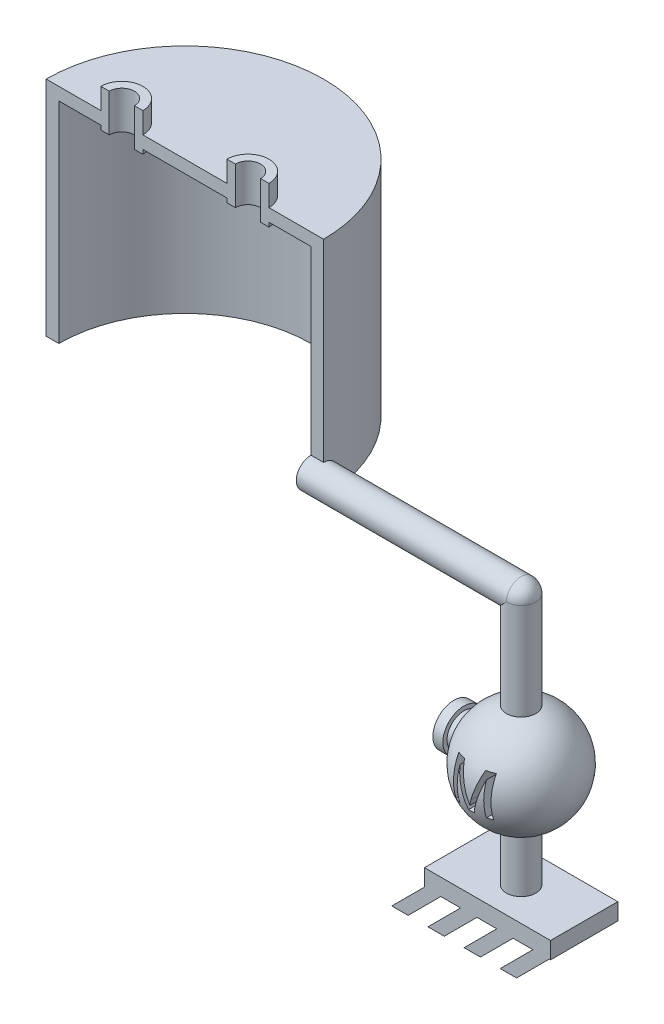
ISO-10303-21;
HEADER;
FILE_DESCRIPTION(('STEP AP214'),'2;1');
FILE_NAME('part.step','',(''),(''),'','','');
FILE_SCHEMA(('AUTOMOTIVE_DESIGN { 1 0 10303 214 1 1 1 1 }'));
ENDSEC;
DATA;
#1=APPLICATION_CONTEXT('core data for automotive mechanical design processes');
#2=APPLICATION_PROTOCOL_DEFINITION('international standard','automotive_design',2000,#1);
#3=PRODUCT_CONTEXT('',#1,'mechanical');
#4=PRODUCT('Part','Part','',(#3));
#5=PRODUCT_RELATED_PRODUCT_CATEGORY('part','',(#4));
#6=PRODUCT_DEFINITION_FORMATION('','',#4);
#7=PRODUCT_DEFINITION_CONTEXT('part definition',#1,'design');
#8=PRODUCT_DEFINITION('design','',#6,#7);
#9=PRODUCT_DEFINITION_SHAPE('','',#8);
#10=(LENGTH_UNIT() NAMED_UNIT(*) SI_UNIT(.MILLI.,.METRE.));
#11=(NAMED_UNIT(*) PLANE_ANGLE_UNIT() SI_UNIT($,.RADIAN.));
#12=(NAMED_UNIT(*) SI_UNIT($,.STERADIAN.) SOLID_ANGLE_UNIT());
#13=UNCERTAINTY_MEASURE_WITH_UNIT(LENGTH_MEASURE(1.E-05),#10,'distance_accuracy_value','');
#14=(GEOMETRIC_REPRESENTATION_CONTEXT(3) GLOBAL_UNCERTAINTY_ASSIGNED_CONTEXT((#13)) GLOBAL_UNIT_ASSIGNED_CONTEXT((#10,
#11,#12)) REPRESENTATION_CONTEXT('',''));
#15=CARTESIAN_POINT('',(0.,0.,0.));
#16=DIRECTION('',(0.,0.,1.));
#17=DIRECTION('',(1.,0.,0.));
#18=AXIS2_PLACEMENT_3D('',#15,#16,#17);
#19=CARTESIAN_POINT('',(15.,-29.,8.));
#20=DIRECTION('',(0.,1.,0.));
#21=DIRECTION('',(0.,0.,1.));
#22=AXIS2_PLACEMENT_3D('',#19,#20,#21);
#23=PLANE('',#22);
#24=DIRECTION('',(1.,0.,0.));
#25=VECTOR('',#24,1.);
#26=CARTESIAN_POINT('',(15.,-29.,-8.));
#27=LINE('',#26,#25);
#28=CARTESIAN_POINT('',(6.08820493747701,-29.,-8.));
#29=VERTEX_POINT('',#28);
#30=CARTESIAN_POINT('',(10.8,-29.,-8.));
#31=VERTEX_POINT('',#30);
#32=EDGE_CURVE('E732',#29,#31,#27,.T.);
#33=ORIENTED_EDGE('',*,*,#32,.T.);
#34=DIRECTION('',(0.,0.,1.));
#35=VECTOR('',#34,1.);
#36=CARTESIAN_POINT('',(10.8,-29.,-22.0191222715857));
#37=LINE('',#36,#35);
#38=CARTESIAN_POINT('',(10.8,-29.,8.));
#39=VERTEX_POINT('',#38);
#40=EDGE_CURVE('E51',#31,#39,#37,.T.);
#41=ORIENTED_EDGE('',*,*,#40,.T.);
#42=DIRECTION('',(-1.,0.,0.));
#43=VECTOR('',#42,1.);
#44=CARTESIAN_POINT('',(15.,-29.,8.));
#45=LINE('',#44,#43);
#46=CARTESIAN_POINT('',(6.08820493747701,-29.,8.));
#47=VERTEX_POINT('',#46);
#48=EDGE_CURVE('E37',#39,#47,#45,.T.);
#49=ORIENTED_EDGE('',*,*,#48,.T.);
#50=DIRECTION('',(0.,0.,1.));
#51=VECTOR('',#50,1.);
#52=CARTESIAN_POINT('',(6.08820493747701,-29.,-22.0191222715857));
#53=LINE('',#52,#51);
#54=EDGE_CURVE('E756',#29,#47,#53,.T.);
#55=ORIENTED_EDGE('',*,*,#54,.F.);
#56=EDGE_LOOP('',(#33,#41,#49,#55));
#57=FACE_BOUND('',#56,.T.);
#58=ADVANCED_FACE('F32',(#57),#23,.F.);
#59=CARTESIAN_POINT('',(-2.51179506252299,-29.,-8.));
#60=VERTEX_POINT('',#59);
#61=CARTESIAN_POINT('',(2.2,-29.,-8.));
#62=VERTEX_POINT('',#61);
#63=EDGE_CURVE('E675',#60,#62,#27,.T.);
#64=ORIENTED_EDGE('',*,*,#63,.T.);
#65=DIRECTION('',(0.,0.,1.));
#66=VECTOR('',#65,1.);
#67=CARTESIAN_POINT('',(2.2,-29.,-22.0191222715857));
#68=LINE('',#67,#66);
#69=CARTESIAN_POINT('',(2.2,-29.,8.));
#70=VERTEX_POINT('',#69);
#71=EDGE_CURVE('E769',#62,#70,#68,.T.);
#72=ORIENTED_EDGE('',*,*,#71,.T.);
#73=CARTESIAN_POINT('',(-2.511795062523,-29.,8.));
#74=VERTEX_POINT('',#73);
#75=EDGE_CURVE('E745',#70,#74,#45,.T.);
#76=ORIENTED_EDGE('',*,*,#75,.T.);
#77=DIRECTION('',(0.,0.,1.));
#78=VECTOR('',#77,1.);
#79=CARTESIAN_POINT('',(-2.51179506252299,-29.,-22.0191222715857));
#80=LINE('',#79,#78);
#81=EDGE_CURVE('E690',#60,#74,#80,.T.);
#82=ORIENTED_EDGE('',*,*,#81,.F.);
#83=EDGE_LOOP('',(#64,#72,#76,#82));
#84=FACE_BOUND('',#83,.T.);
#85=ADVANCED_FACE('F642',(#84),#23,.F.);
#86=CARTESIAN_POINT('',(-11.111795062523,-29.,-8.));
#87=VERTEX_POINT('',#86);
#88=CARTESIAN_POINT('',(-6.4,-29.,-8.));
#89=VERTEX_POINT('',#88);
#90=EDGE_CURVE('E665',#87,#89,#27,.T.);
#91=ORIENTED_EDGE('',*,*,#90,.T.);
#92=DIRECTION('',(0.,0.,1.));
#93=VECTOR('',#92,1.);
#94=CARTESIAN_POINT('',(-6.4,-29.,-22.0191222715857));
#95=LINE('',#94,#93);
#96=CARTESIAN_POINT('',(-6.4,-29.,8.));
#97=VERTEX_POINT('',#96);
#98=EDGE_CURVE('E668',#89,#97,#95,.T.);
#99=ORIENTED_EDGE('',*,*,#98,.T.);
#100=CARTESIAN_POINT('',(-11.111795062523,-29.,8.));
#101=VERTEX_POINT('',#100);
#102=EDGE_CURVE('E733',#97,#101,#45,.T.);
#103=ORIENTED_EDGE('',*,*,#102,.T.);
#104=DIRECTION('',(0.,0.,1.));
#105=VECTOR('',#104,1.);
#106=CARTESIAN_POINT('',(-11.111795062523,-29.,-22.0191222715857));
#107=LINE('',#106,#105);
#108=EDGE_CURVE('E671',#87,#101,#107,.T.);
#109=ORIENTED_EDGE('',*,*,#108,.F.);
#110=EDGE_LOOP('',(#91,#99,#103,#109));
#111=FACE_BOUND('',#110,.T.);
#112=ADVANCED_FACE('F648',(#111),#23,.F.);
#113=CARTESIAN_POINT('',(15.,-29.,8.));
#114=VERTEX_POINT('',#113);
#115=CARTESIAN_POINT('',(14.688204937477,-29.,8.));
#116=VERTEX_POINT('',#115);
#117=EDGE_CURVE('E59',#114,#116,#45,.T.);
#118=ORIENTED_EDGE('',*,*,#117,.T.);
#119=DIRECTION('',(0.,0.,1.));
#120=VECTOR('',#119,1.);
#121=CARTESIAN_POINT('',(14.688204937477,-29.,-22.0191222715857));
#122=LINE('',#121,#120);
#123=CARTESIAN_POINT('',(14.688204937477,-29.,-8.));
#124=VERTEX_POINT('',#123);
#125=EDGE_CURVE('E817',#124,#116,#122,.T.);
#126=ORIENTED_EDGE('',*,*,#125,.F.);
#127=CARTESIAN_POINT('',(15.,-29.,-8.));
#128=VERTEX_POINT('',#127);
#129=EDGE_CURVE('E744',#124,#128,#27,.T.);
#130=ORIENTED_EDGE('',*,*,#129,.T.);
#131=DIRECTION('',(0.,0.,1.));
#132=VECTOR('',#131,1.);
#133=CARTESIAN_POINT('',(15.,-29.,8.));
#134=LINE('',#133,#132);
#135=EDGE_CURVE('E748',#128,#114,#134,.T.);
#136=ORIENTED_EDGE('',*,*,#135,.T.);
#137=EDGE_LOOP('',(#118,#126,#130,#136));
#138=FACE_BOUND('',#137,.T.);
#139=ADVANCED_FACE('F644',(#138),#23,.F.);
#140=CARTESIAN_POINT('',(-110.,81.5,2.09488880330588E-13));
#141=DIRECTION('',(0.,0.,-1.));
#142=DIRECTION('',(-1.,0.,0.));
#143=AXIS2_PLACEMENT_3D('',#140,#141,#142);
#144=PLANE('',#143);
#145=DIRECTION('',(1.,0.,0.));
#146=VECTOR('',#145,1.);
#147=CARTESIAN_POINT('',(-100.,80.5,1.85048510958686E-13));
#148=LINE('',#147,#146);
#149=CARTESIAN_POINT('',(-100.,80.5,1.85048510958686E-13));
#150=VERTEX_POINT('',#149);
#151=CARTESIAN_POINT('',(-98.,80.5,1.78065548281E-13));
#152=VERTEX_POINT('',#151);
#153=EDGE_CURVE('E974',#150,#152,#148,.T.);
#154=ORIENTED_EDGE('',*,*,#153,.T.);
#155=DIRECTION('',(0.,1.,0.));
#156=VECTOR('',#155,1.);
#157=CARTESIAN_POINT('',(-98.,72.5,1.25693328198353E-13));
#158=LINE('',#157,#156);
#159=CARTESIAN_POINT('',(-98.,89.5,1.78065548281E-13));
#160=VERTEX_POINT('',#159);
#161=EDGE_CURVE('E930',#152,#160,#158,.T.);
#162=ORIENTED_EDGE('',*,*,#161,.T.);
#163=DIRECTION('',(1.,0.,0.));
#164=VECTOR('',#163,1.);
#165=CARTESIAN_POINT('',(-100.,89.5,1.85048510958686E-13));
#166=LINE('',#165,#164);
#167=CARTESIAN_POINT('',(-100.,89.5,1.85048510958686E-13));
#168=VERTEX_POINT('',#167);
#169=EDGE_CURVE('E981',#168,#160,#166,.T.);
#170=ORIENTED_EDGE('',*,*,#169,.F.);
#171=DIRECTION('',(0.,-1.,0.));
#172=VECTOR('',#171,1.);
#173=CARTESIAN_POINT('',(-100.,89.5,1.85048510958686E-13));
#174=LINE('',#173,#172);
#175=CARTESIAN_POINT('',(-100.,84.5,1.39659253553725E-13));
#176=VERTEX_POINT('',#175);
#177=EDGE_CURVE('E989',#168,#176,#174,.T.);
#178=ORIENTED_EDGE('',*,*,#177,.T.);
#179=DIRECTION('',(1.,0.,0.));
#180=VECTOR('',#179,1.);
#181=CARTESIAN_POINT('',(-110.,84.5,2.09488880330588E-13));
#182=LINE('',#181,#180);
#183=CARTESIAN_POINT('',(-113.,84.5,2.30437768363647E-13));
#184=VERTEX_POINT('',#183);
#185=EDGE_CURVE('E1016',#184,#176,#182,.T.);
#186=ORIENTED_EDGE('',*,*,#185,.F.);
#187=DIRECTION('',(0.,1.,0.));
#188=VECTOR('',#187,1.);
#189=CARTESIAN_POINT('',(-113.,31.5,2.30437768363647E-13));
#190=LINE('',#189,#188);
#191=CARTESIAN_POINT('',(-113.,31.5,2.30437768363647E-13));
#192=VERTEX_POINT('',#191);
#193=EDGE_CURVE('E1012',#192,#184,#190,.T.);
#194=ORIENTED_EDGE('',*,*,#193,.F.);
#195=DIRECTION('',(-1.,0.,0.));
#196=VECTOR('',#195,1.);
#197=CARTESIAN_POINT('',(-110.,31.5,2.09488880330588E-13));
#198=LINE('',#197,#196);
#199=CARTESIAN_POINT('',(-110.,31.5,2.09488880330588E-13));
#200=VERTEX_POINT('',#199);
#201=EDGE_CURVE('E1009',#200,#192,#198,.T.);
#202=ORIENTED_EDGE('',*,*,#201,.F.);
#203=DIRECTION('',(0.,-1.,0.));
#204=VECTOR('',#203,1.);
#205=CARTESIAN_POINT('',(-110.,31.5,2.09488880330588E-13));
#206=LINE('',#205,#204);
#207=CARTESIAN_POINT('',(-110.,81.5,2.09488880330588E-13));
#208=VERTEX_POINT('',#207);
#209=EDGE_CURVE('E1006',#208,#200,#206,.T.);
#210=ORIENTED_EDGE('',*,*,#209,.F.);
#211=DIRECTION('',(-1.,0.,0.));
#212=VECTOR('',#211,1.);
#213=CARTESIAN_POINT('',(-110.,81.5,2.09488880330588E-13));
#214=LINE('',#213,#212);
#215=CARTESIAN_POINT('',(-100.,81.5,1.85048510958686E-13));
#216=VERTEX_POINT('',#215);
#217=EDGE_CURVE('E1018',#216,#208,#214,.T.);
#218=ORIENTED_EDGE('',*,*,#217,.F.);
#219=EDGE_CURVE('E988',#216,#150,#174,.T.);
#220=ORIENTED_EDGE('',*,*,#219,.T.);
#221=EDGE_LOOP('',(#154,#162,#170,#178,#186,#194,#202,#210,#218,#220));
#222=FACE_BOUND('',#221,.T.);
#223=ADVANCED_FACE('F653',(#222),#144,.F.);
#224=CARTESIAN_POINT('',(-92.,89.5,1.57116660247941E-13));
#225=VERTEX_POINT('',#224);
#226=CARTESIAN_POINT('',(-90.,89.5,1.50133697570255E-13));
#227=VERTEX_POINT('',#226);
#228=EDGE_CURVE('E980',#225,#227,#166,.T.);
#229=ORIENTED_EDGE('',*,*,#228,.F.);
#230=DIRECTION('',(0.,1.,0.));
#231=VECTOR('',#230,1.);
#232=CARTESIAN_POINT('',(-92.,72.5,0.));
#233=LINE('',#232,#231);
#234=CARTESIAN_POINT('',(-92.,80.5,1.57116660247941E-13));
#235=VERTEX_POINT('',#234);
#236=EDGE_CURVE('E927',#225,#235,#233,.F.);
#237=ORIENTED_EDGE('',*,*,#236,.T.);
#238=CARTESIAN_POINT('',(-90.,80.5,1.50133697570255E-13));
#239=VERTEX_POINT('',#238);
#240=EDGE_CURVE('E973',#235,#239,#148,.T.);
#241=ORIENTED_EDGE('',*,*,#240,.T.);
#242=DIRECTION('',(0.,-1.,0.));
#243=VECTOR('',#242,1.);
#244=CARTESIAN_POINT('',(-90.,89.5,1.50133697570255E-13));
#245=LINE('',#244,#243);
#246=CARTESIAN_POINT('',(-90.,81.5,0.));
#247=VERTEX_POINT('',#246);
#248=EDGE_CURVE('E984',#247,#239,#245,.T.);
#249=ORIENTED_EDGE('',*,*,#248,.F.);
#250=CARTESIAN_POINT('',(-70.,81.5,0.));
#251=VERTEX_POINT('',#250);
#252=EDGE_CURVE('E1023',#251,#247,#214,.T.);
#253=ORIENTED_EDGE('',*,*,#252,.F.);
#254=DIRECTION('',(0.,-1.,0.));
#255=VECTOR('',#254,1.);
#256=CARTESIAN_POINT('',(-70.,89.5,0.));
#257=LINE('',#256,#255);
#258=CARTESIAN_POINT('',(-70.,80.5,0.));
#259=VERTEX_POINT('',#258);
#260=EDGE_CURVE('E960',#251,#259,#257,.T.);
#261=ORIENTED_EDGE('',*,*,#260,.T.);
#262=DIRECTION('',(1.,0.,0.));
#263=VECTOR('',#262,1.);
#264=CARTESIAN_POINT('',(-70.,80.5,0.));
#265=LINE('',#264,#263);
#266=CARTESIAN_POINT('',(-68.,80.5,0.));
#267=VERTEX_POINT('',#266);
#268=EDGE_CURVE('E946',#259,#267,#265,.T.);
#269=ORIENTED_EDGE('',*,*,#268,.T.);
#270=DIRECTION('',(0.,1.,0.));
#271=VECTOR('',#270,1.);
#272=CARTESIAN_POINT('',(-68.,72.5,0.));
#273=LINE('',#272,#271);
#274=CARTESIAN_POINT('',(-68.,89.5,0.));
#275=VERTEX_POINT('',#274);
#276=EDGE_CURVE('E939',#267,#275,#273,.T.);
#277=ORIENTED_EDGE('',*,*,#276,.T.);
#278=DIRECTION('',(1.,0.,0.));
#279=VECTOR('',#278,1.);
#280=CARTESIAN_POINT('',(-70.,89.5,0.));
#281=LINE('',#280,#279);
#282=CARTESIAN_POINT('',(-70.,89.5,0.));
#283=VERTEX_POINT('',#282);
#284=EDGE_CURVE('E953',#283,#275,#281,.T.);
#285=ORIENTED_EDGE('',*,*,#284,.F.);
#286=CARTESIAN_POINT('',(-70.,84.5,0.));
#287=VERTEX_POINT('',#286);
#288=EDGE_CURVE('E961',#283,#287,#257,.T.);
#289=ORIENTED_EDGE('',*,*,#288,.T.);
#290=CARTESIAN_POINT('',(-90.,84.5,1.50133697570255E-13));
#291=VERTEX_POINT('',#290);
#292=EDGE_CURVE('E1019',#291,#287,#182,.T.);
#293=ORIENTED_EDGE('',*,*,#292,.F.);
#294=EDGE_CURVE('E985',#227,#291,#245,.T.);
#295=ORIENTED_EDGE('',*,*,#294,.F.);
#296=EDGE_LOOP('',(#229,#237,#241,#249,#253,#261,#269,#277,#285,#289,#293,#295));
#297=FACE_BOUND('',#296,.T.);
#298=ADVANCED_FACE('F658',(#297),#144,.F.);
#299=CARTESIAN_POINT('',(-110.,84.5,2.09488880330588E-13));
#300=DIRECTION('',(0.,1.,0.));
#301=DIRECTION('',(-1.,0.,0.));
#302=AXIS2_PLACEMENT_3D('',#299,#300,#301);
#303=PLANE('',#302);
#304=ORIENTED_EDGE('',*,*,#292,.T.);
#305=CARTESIAN_POINT('',(-65.,84.5,0.));
#306=DIRECTION('',(0.,1.,0.));
#307=DIRECTION('',(-1.,0.,0.));
#308=AXIS2_PLACEMENT_3D('',#305,#306,#307);
#309=CIRCLE('',#308,5.);
#310=CARTESIAN_POINT('',(-60.,84.5,0.));
#311=VERTEX_POINT('',#310);
#312=EDGE_CURVE('E967',#287,#311,#309,.F.);
#313=ORIENTED_EDGE('',*,*,#312,.T.);
#314=CARTESIAN_POINT('',(-47.,84.5,0.));
#315=VERTEX_POINT('',#314);
#316=EDGE_CURVE('E1015',#311,#315,#182,.T.);
#317=ORIENTED_EDGE('',*,*,#316,.T.);
#318=CARTESIAN_POINT('',(-80.,84.5,0.));
#319=DIRECTION('',(0.,-1.,0.));
#320=DIRECTION('',(1.,0.,0.));
#321=AXIS2_PLACEMENT_3D('',#318,#319,#320);
#322=CIRCLE('',#321,33.);
#323=EDGE_CURVE('E1026',#184,#315,#322,.T.);
#324=ORIENTED_EDGE('',*,*,#323,.F.);
#325=ORIENTED_EDGE('',*,*,#185,.T.);
#326=CARTESIAN_POINT('',(-95.,84.5,0.));
#327=DIRECTION('',(0.,1.,0.));
#328=DIRECTION('',(-1.,0.,0.));
#329=AXIS2_PLACEMENT_3D('',#326,#327,#328);
#330=CIRCLE('',#329,5.);
#331=EDGE_CURVE('E995',#176,#291,#330,.F.);
#332=ORIENTED_EDGE('',*,*,#331,.T.);
#333=EDGE_LOOP('',(#304,#313,#317,#324,#325,#332));
#334=FACE_BOUND('',#333,.T.);
#335=ADVANCED_FACE('F630',(#334),#303,.T.);
#336=CARTESIAN_POINT('',(-110.,81.5,2.09488880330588E-13));
#337=DIRECTION('',(0.,-1.,0.));
#338=DIRECTION('',(1.,0.,0.));
#339=AXIS2_PLACEMENT_3D('',#336,#337,#338);
#340=PLANE('',#339);
#341=CARTESIAN_POINT('',(-50.,81.5,0.));
#342=VERTEX_POINT('',#341);
#343=CARTESIAN_POINT('',(-60.,81.5,-1.39659253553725E-13));
#344=VERTEX_POINT('',#343);
#345=EDGE_CURVE('E1020',#342,#344,#214,.T.);
#346=ORIENTED_EDGE('',*,*,#345,.T.);
#347=CARTESIAN_POINT('',(-65.,81.5,0.));
#348=DIRECTION('',(0.,-1.,0.));
#349=DIRECTION('',(1.,0.,0.));
#350=AXIS2_PLACEMENT_3D('',#347,#348,#349);
#351=CIRCLE('',#350,5.);
#352=EDGE_CURVE('E964',#344,#251,#351,.F.);
#353=ORIENTED_EDGE('',*,*,#352,.T.);
#354=ORIENTED_EDGE('',*,*,#252,.T.);
#355=CARTESIAN_POINT('',(-95.,81.5,0.));
#356=DIRECTION('',(0.,-1.,0.));
#357=DIRECTION('',(1.,0.,0.));
#358=AXIS2_PLACEMENT_3D('',#355,#356,#357);
#359=CIRCLE('',#358,5.);
#360=EDGE_CURVE('E992',#247,#216,#359,.F.);
#361=ORIENTED_EDGE('',*,*,#360,.T.);
#362=ORIENTED_EDGE('',*,*,#217,.T.);
#363=CARTESIAN_POINT('',(-80.,81.5,0.));
#364=DIRECTION('',(0.,-1.,0.));
#365=DIRECTION('',(1.,0.,0.));
#366=AXIS2_PLACEMENT_3D('',#363,#364,#365);
#367=CIRCLE('',#366,30.);
#368=EDGE_CURVE('E1022',#208,#342,#367,.T.);
#369=ORIENTED_EDGE('',*,*,#368,.T.);
#370=EDGE_LOOP('',(#346,#353,#354,#361,#362,#369));
#371=FACE_BOUND('',#370,.T.);
#372=ADVANCED_FACE('F640',(#371),#340,.T.);
#373=CARTESIAN_POINT('',(-50.,35.,0.));
#374=DIRECTION('',(1.,0.,0.));
#375=DIRECTION('',(0.,0.,-1.));
#376=AXIS2_PLACEMENT_3D('',#373,#374,#375);
#377=CYLINDRICAL_SURFACE('',#376,3.5);
#378=CARTESIAN_POINT('',(0.,35.,0.));
#379=DIRECTION('',(0.707106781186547,-0.707106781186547,0.));
#380=DIRECTION('',(-0.707106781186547,-0.707106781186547,0.));
#381=AXIS2_PLACEMENT_3D('',#378,#379,#380);
#382=ELLIPSE('',#381,4.94974746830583,3.5);
#383=CARTESIAN_POINT('',(0.,35.,3.5));
#384=VERTEX_POINT('',#383);
#385=CARTESIAN_POINT('',(0.,35.,-3.5));
#386=VERTEX_POINT('',#385);
#387=EDGE_CURVE('E376',#384,#386,#382,.T.);
#388=ORIENTED_EDGE('',*,*,#387,.F.);
#389=CARTESIAN_POINT('',(0.,35.,0.));
#390=DIRECTION('',(1.,0.,0.));
#391=DIRECTION('',(0.,0.,-1.));
#392=AXIS2_PLACEMENT_3D('',#389,#390,#391);
#393=CIRCLE('',#392,3.5);
#394=EDGE_CURVE('E381',#386,#384,#393,.T.);
#395=ORIENTED_EDGE('',*,*,#394,.F.);
#396=EDGE_LOOP('',(#388,#395));
#397=FACE_BOUND('',#396,.T.);
#398=CARTESIAN_POINT('',(-47.,38.5,0.));
#399=CARTESIAN_POINT('',(-46.9999957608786,38.5000097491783,-0.0981478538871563));
#400=CARTESIAN_POINT('',(-47.0004377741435,38.495871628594,-0.196290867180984));
#401=CARTESIAN_POINT('',(-47.0021829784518,38.479375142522,-0.391869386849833));
#402=CARTESIAN_POINT('',(-47.00348611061,38.4670173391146,-0.489304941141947));
#403=CARTESIAN_POINT('',(-47.006920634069,38.4341722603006,-0.682694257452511));
#404=CARTESIAN_POINT('',(-47.0090512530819,38.4136925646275,-0.778649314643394));
#405=CARTESIAN_POINT('',(-47.0140769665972,38.3647740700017,-0.968459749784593));
#406=CARTESIAN_POINT('',(-47.0169720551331,38.3363353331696,-1.06231514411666));
#407=CARTESIAN_POINT('',(-47.0266922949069,38.2393255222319,-1.339807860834));
#408=CARTESIAN_POINT('',(-47.0345543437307,38.159043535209,-1.51947304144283));
#409=CARTESIAN_POINT('',(-47.052160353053,37.9696740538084,-1.86265952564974));
#410=CARTESIAN_POINT('',(-47.0619041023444,37.8605897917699,-2.02618263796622));
#411=CARTESIAN_POINT('',(-47.082226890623,37.6162233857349,-2.33323449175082));
#412=CARTESIAN_POINT('',(-47.092808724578,37.4808511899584,-2.47669150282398));
#413=CARTESIAN_POINT('',(-47.1135930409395,37.1879354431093,-2.73890351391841));
#414=CARTESIAN_POINT('',(-47.1237954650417,37.0303885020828,-2.85765473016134));
#415=CARTESIAN_POINT('',(-47.142693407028,36.6971422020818,-3.06733599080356));
#416=CARTESIAN_POINT('',(-47.151385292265,36.5214006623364,-3.15819935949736));
#417=CARTESIAN_POINT('',(-47.1662415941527,36.157057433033,-3.30909236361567));
#418=CARTESIAN_POINT('',(-47.1724062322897,35.9684568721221,-3.36912470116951));
#419=CARTESIAN_POINT('',(-47.1814846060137,35.584491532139,-3.45644134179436));
#420=CARTESIAN_POINT('',(-47.1844104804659,35.3891548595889,-3.48384795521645));
#421=CARTESIAN_POINT('',(-47.1867175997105,34.9966292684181,-3.50551328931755));
#422=CARTESIAN_POINT('',(-47.1860988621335,34.7994403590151,-3.49977217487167));
#423=CARTESIAN_POINT('',(-47.1813976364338,34.4096637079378,-3.45540462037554));
#424=CARTESIAN_POINT('',(-47.177329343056,34.2170604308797,-3.4169129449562));
#425=CARTESIAN_POINT('',(-47.1662095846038,33.8410640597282,-3.30834686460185));
#426=CARTESIAN_POINT('',(-47.1591580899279,33.6576710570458,-3.2382721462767));
#427=CARTESIAN_POINT('',(-47.1428499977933,33.3048725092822,-3.06837978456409));
#428=CARTESIAN_POINT('',(-47.1335889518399,33.1354961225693,-2.96850203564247));
#429=CARTESIAN_POINT('',(-47.1139094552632,32.8158663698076,-2.74188624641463));
#430=CARTESIAN_POINT('',(-47.1034910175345,32.665612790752,-2.61514850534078));
#431=CARTESIAN_POINT('',(-47.0826084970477,32.3877218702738,-2.33767926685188));
#432=CARTESIAN_POINT('',(-47.0721444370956,32.260197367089,-2.18683474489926));
#433=CARTESIAN_POINT('',(-47.0523938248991,32.0322235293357,-1.86576204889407));
#434=CARTESIAN_POINT('',(-47.0431076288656,31.9317823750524,-1.69552804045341));
#435=CARTESIAN_POINT('',(-47.0267543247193,31.7608328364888,-1.34040628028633));
#436=CARTESIAN_POINT('',(-47.0196889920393,31.6903483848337,-1.15550695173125));
#437=CARTESIAN_POINT('',(-47.0085959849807,31.5815625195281,-0.776543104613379));
#438=CARTESIAN_POINT('',(-47.0045637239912,31.5432125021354,-0.582492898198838));
#439=CARTESIAN_POINT('',(-47.0015130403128,31.514291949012,-0.322563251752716));
#440=CARTESIAN_POINT('',(-47.0009460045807,31.5089298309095,-0.258111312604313));
#441=CARTESIAN_POINT('',(-47.0001899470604,31.5017886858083,-0.129115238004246));
#442=CARTESIAN_POINT('',(-47.0000002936,31.5000036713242,-0.0645714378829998));
#443=CARTESIAN_POINT('',(-47.,31.5,0.));
#444=B_SPLINE_CURVE_WITH_KNOTS('',3,(#398,#399,#400,#401,#402,#403,#404,#405,#406,#407,#408,
#409,#410,#411,#412,#413,#414,#415,#416,#417,#418,#419,#420,#421,#422,#423,#424,#425,#426,#427,
#428,#429,#430,#431,#432,#433,#434,#435,#436,#437,#438,#439,#440,#441,#442,#443),.UNSPECIFIED.,
.F.,.F.,(4,2,2,2,2,2,2,2,2,2,2,2,2,2,2,2,2,2,2,2,2,2,4),(0.,0.294346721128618,0.588673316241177,
0.882725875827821,1.17677614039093,1.76457212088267,2.35230216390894,2.94208222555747,
3.53195254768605,4.12322236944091,4.7144403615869,5.30343488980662,5.89242648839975,
6.47900611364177,7.06559155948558,7.65336809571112,8.24113808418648,8.83174935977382,
9.42253882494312,10.0137993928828,10.6041640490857,10.7981231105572,10.9917572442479),.UNSPECIFIED.);
#445=CARTESIAN_POINT('',(-47.,38.5,0.));
#446=VERTEX_POINT('',#445);
#447=CARTESIAN_POINT('',(-47.,31.5,-2.09488880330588E-13));
#448=VERTEX_POINT('',#447);
#449=EDGE_CURVE('E613',#446,#448,#444,.T.);
#450=ORIENTED_EDGE('',*,*,#449,.F.);
#451=DIRECTION('',(1.,0.,0.));
#452=VECTOR('',#451,1.);
#453=CARTESIAN_POINT('',(-50.,38.5,-2.09488880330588E-13));
#454=LINE('',#453,#452);
#455=CARTESIAN_POINT('',(-50.,38.5,0.));
#456=VERTEX_POINT('',#455);
#457=EDGE_CURVE('E392',#446,#456,#454,.F.);
#458=ORIENTED_EDGE('',*,*,#457,.T.);
#459=CARTESIAN_POINT('',(-50.,35.,0.));
#460=DIRECTION('',(1.,0.,0.));
#461=DIRECTION('',(0.,0.,-1.));
#462=AXIS2_PLACEMENT_3D('',#459,#460,#461);
#463=CIRCLE('',#462,3.5);
#464=CARTESIAN_POINT('',(-50.,31.5,-2.09488880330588E-13));
#465=VERTEX_POINT('',#464);
#466=EDGE_CURVE('E385',#456,#465,#463,.T.);
#467=ORIENTED_EDGE('',*,*,#466,.T.);
#468=DIRECTION('',(1.,0.,0.));
#469=VECTOR('',#468,1.);
#470=CARTESIAN_POINT('',(-50.,31.5,0.));
#471=LINE('',#470,#469);
#472=EDGE_CURVE('E1001',#465,#448,#471,.T.);
#473=ORIENTED_EDGE('',*,*,#472,.T.);
#474=EDGE_LOOP('',(#450,#458,#467,#473));
#475=FACE_BOUND('',#474,.T.);
#476=ADVANCED_FACE('F378',(#397,#475),#377,.T.);
#477=CARTESIAN_POINT('',(-50.,35.,0.));
#478=DIRECTION('',(1.,0.,0.));
#479=DIRECTION('',(0.,0.,-1.));
#480=AXIS2_PLACEMENT_3D('',#477,#478,#479);
#481=PLANE('',#480);
#482=DIRECTION('',(0.,1.,0.));
#483=VECTOR('',#482,1.);
#484=CARTESIAN_POINT('',(-50.,35.,-2.09488880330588E-13));
#485=LINE('',#484,#483);
#486=EDGE_CURVE('E610',#465,#456,#485,.T.);
#487=ORIENTED_EDGE('',*,*,#486,.F.);
#488=ORIENTED_EDGE('',*,*,#466,.F.);
#489=EDGE_LOOP('',(#487,#488));
#490=FACE_BOUND('',#489,.T.);
#491=ADVANCED_FACE('F454',(#490),#481,.F.);
#492=CARTESIAN_POINT('',(-0.161955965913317,-1.84355761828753,0.));
#493=DIRECTION('',(0.,0.,-1.));
#494=DIRECTION('',(-1.,0.,0.));
#495=AXIS2_PLACEMENT_3D('',#492,#493,#494);
#496=PLANE('',#495);
#497=DIRECTION('',(0.,1.,0.));
#498=VECTOR('',#497,1.);
#499=CARTESIAN_POINT('',(-3.5,-25.,0.));
#500=LINE('',#499,#498);
#501=CARTESIAN_POINT('',(-3.5,-3.92349663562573,0.));
#502=VERTEX_POINT('',#501);
#503=CARTESIAN_POINT('',(-3.5,5.32245062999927,0.));
#504=VERTEX_POINT('',#503);
#505=EDGE_CURVE('E607',#502,#504,#500,.T.);
#506=ORIENTED_EDGE('',*,*,#505,.T.);
#507=DIRECTION('',(1.,0.,0.));
#508=VECTOR('',#507,1.);
#509=CARTESIAN_POINT('',(-4.40168871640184,5.32245062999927,0.));
#510=LINE('',#509,#508);
#511=CARTESIAN_POINT('',(-4.40168871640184,5.32245062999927,0.));
#512=VERTEX_POINT('',#511);
#513=EDGE_CURVE('E1613',#512,#504,#510,.T.);
#514=ORIENTED_EDGE('',*,*,#513,.F.);
#515=DIRECTION('',(0.,1.,0.));
#516=VECTOR('',#515,1.);
#517=CARTESIAN_POINT('',(-4.40168871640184,-3.92349663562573,0.));
#518=LINE('',#517,#516);
#519=CARTESIAN_POINT('',(-4.40168871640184,-3.92349663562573,0.));
#520=VERTEX_POINT('',#519);
#521=EDGE_CURVE('E1610',#520,#512,#518,.T.);
#522=ORIENTED_EDGE('',*,*,#521,.F.);
#523=DIRECTION('',(-1.,0.,0.));
#524=VECTOR('',#523,1.);
#525=CARTESIAN_POINT('',(-3.09777307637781,-3.92349663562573,0.));
#526=LINE('',#525,#524);
#527=EDGE_CURVE('E1608',#502,#520,#526,.T.);
#528=ORIENTED_EDGE('',*,*,#527,.F.);
#529=EDGE_LOOP('',(#506,#514,#522,#528));
#530=FACE_BOUND('',#529,.T.);
#531=ADVANCED_FACE('F450',(#530),#496,.F.);
#532=CARTESIAN_POINT('',(0.,0.,0.));
#533=DIRECTION('',(1.,0.,0.));
#534=DIRECTION('',(0.,1.,0.));
#535=AXIS2_PLACEMENT_3D('',#532,#533,#534);
#536=SPHERICAL_SURFACE('',#535,12.5);
#537=CARTESIAN_POINT('',(-11.842719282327,0.,0.));
#538=DIRECTION('',(1.,0.,0.));
#539=DIRECTION('',(0.,0.,-1.));
#540=AXIS2_PLACEMENT_3D('',#537,#538,#539);
#541=CIRCLE('',#540,4.);
#542=CARTESIAN_POINT('',(-11.842719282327,0.,-4.));
#543=VERTEX_POINT('',#542);
#544=EDGE_CURVE('E565',#543,#543,#541,.T.);
#545=ORIENTED_EDGE('',*,*,#544,.T.);
#546=EDGE_LOOP('',(#545));
#547=FACE_BOUND('',#546,.T.);
#548=CARTESIAN_POINT('',(0.,-3.92349663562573,0.));
#549=DIRECTION('',(0.,-1.,0.));
#550=DIRECTION('',(0.,0.,-1.));
#551=AXIS2_PLACEMENT_3D('',#548,#549,#550);
#552=CIRCLE('',#551,11.8682843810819);
#553=CARTESIAN_POINT('',(-4.40168871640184,-3.92349663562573,11.0218560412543));
#554=VERTEX_POINT('',#553);
#555=CARTESIAN_POINT('',(-3.09777307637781,-3.92349663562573,11.4568746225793));
#556=VERTEX_POINT('',#555);
#557=EDGE_CURVE('E602',#554,#556,#552,.F.);
#558=ORIENTED_EDGE('',*,*,#557,.F.);
#559=CARTESIAN_POINT('',(-4.40168871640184,0.,0.));
#560=DIRECTION('',(-1.,0.,0.));
#561=DIRECTION('',(0.,0.,1.));
#562=AXIS2_PLACEMENT_3D('',#559,#560,#561);
#563=CIRCLE('',#562,11.6993647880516);
#564=CARTESIAN_POINT('',(-4.40168871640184,5.32245062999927,10.418572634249));
#565=VERTEX_POINT('',#564);
#566=EDGE_CURVE('E568',#565,#554,#563,.F.);
#567=ORIENTED_EDGE('',*,*,#566,.F.);
#568=CARTESIAN_POINT('',(0.,5.32245062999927,0.));
#569=DIRECTION('',(0.,1.,0.));
#570=DIRECTION('',(0.,0.,1.));
#571=AXIS2_PLACEMENT_3D('',#568,#569,#570);
#572=CIRCLE('',#571,11.3102395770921);
#573=CARTESIAN_POINT('',(-2.4402587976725,5.32245062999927,11.0438515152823));
#574=VERTEX_POINT('',#573);
#575=EDGE_CURVE('E570',#574,#565,#572,.F.);
#576=ORIENTED_EDGE('',*,*,#575,.F.);
#577=CARTESIAN_POINT('',(-0.675999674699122,-0.215362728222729,0.));
#578=DIRECTION('',(0.95281497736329,0.303551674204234,0.));
#579=DIRECTION('',(-0.303551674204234,0.95281497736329,0.));
#580=AXIS2_PLACEMENT_3D('',#577,#578,#579);
#581=CIRCLE('',#580,12.4798494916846);
#582=CARTESIAN_POINT('',(-0.373256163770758,-1.16564097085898,12.4399341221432));
#583=VERTEX_POINT('',#582);
#584=EDGE_CURVE('E573',#583,#574,#581,.F.);
#585=ORIENTED_EDGE('',*,*,#584,.F.);
#586=CARTESIAN_POINT('',(0.0434782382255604,-2.5232690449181,12.2425987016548));
#587=CARTESIAN_POINT('',(0.0394217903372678,-2.50921051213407,12.2455106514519));
#588=CARTESIAN_POINT('',(0.0353649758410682,-2.4951465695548,12.2483964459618));
#589=CARTESIAN_POINT('',(0.0272119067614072,-2.46701911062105,12.2541135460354));
#590=CARTESIAN_POINT('',(0.0231156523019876,-2.45295559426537,12.2569448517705));
#591=CARTESIAN_POINT('',(0.0148450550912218,-2.42484042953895,12.2625507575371));
#592=CARTESIAN_POINT('',(0.0106707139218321,-2.41078878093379,12.2653253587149));
#593=CARTESIAN_POINT('',(0.00221798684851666,-2.38270547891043,12.2708162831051));
#594=CARTESIAN_POINT('',(-0.00206039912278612,-2.36867382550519,12.2735326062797));
#595=CARTESIAN_POINT('',(-0.0149602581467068,-2.3265830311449,12.281599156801));
#596=CARTESIAN_POINT('',(-0.0236464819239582,-2.29852789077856,12.2868669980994));
#597=CARTESIAN_POINT('',(-0.0407341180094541,-2.24229528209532,12.297208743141));
#598=CARTESIAN_POINT('',(-0.0491355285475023,-2.21411781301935,12.3022826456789));
#599=CARTESIAN_POINT('',(-0.0659741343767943,-2.15774043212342,12.3122172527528));
#600=CARTESIAN_POINT('',(-0.0744113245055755,-2.12954052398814,12.31707798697));
#601=CARTESIAN_POINT('',(-0.0915367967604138,-2.07317914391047,12.3265745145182));
#602=CARTESIAN_POINT('',(-0.100225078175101,-2.04501767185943,12.3312103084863));
#603=CARTESIAN_POINT('',(-0.117599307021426,-1.98866067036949,12.3402710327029));
#604=CARTESIAN_POINT('',(-0.126285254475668,-1.96046514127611,12.3446959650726));
#605=CARTESIAN_POINT('',(-0.143559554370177,-1.90401270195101,12.3533402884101));
#606=CARTESIAN_POINT('',(-0.152147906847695,-1.87575579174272,12.3575596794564));
#607=CARTESIAN_POINT('',(-0.169395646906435,-1.81913385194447,12.3657977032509));
#608=CARTESIAN_POINT('',(-0.178055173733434,-1.79076876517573,12.3698156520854));
#609=CARTESIAN_POINT('',(-0.195490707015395,-1.73404450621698,12.3776317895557));
#610=CARTESIAN_POINT('',(-0.204266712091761,-1.70568533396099,12.3814299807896));
#611=CARTESIAN_POINT('',(-0.230751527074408,-1.62061409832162,12.3924955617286));
#612=CARTESIAN_POINT('',(-0.248617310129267,-1.56390774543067,12.3994340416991));
#613=CARTESIAN_POINT('',(-0.275505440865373,-1.47877697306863,12.4091987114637));
#614=CARTESIAN_POINT('',(-0.284486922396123,-1.45037600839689,12.4123476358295));
#615=CARTESIAN_POINT('',(-0.302387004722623,-1.39353172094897,12.4184350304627));
#616=CARTESIAN_POINT('',(-0.311305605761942,-1.36508839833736,12.4213735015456));
#617=CARTESIAN_POINT('',(-0.329075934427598,-1.30815984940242,12.4270400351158));
#618=CARTESIAN_POINT('',(-0.337927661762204,-1.27967462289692,12.4297680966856));
#619=CARTESIAN_POINT('',(-0.355603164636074,-1.22267571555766,12.4350113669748));
#620=CARTESIAN_POINT('',(-0.364426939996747,-1.19416203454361,12.4375265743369));
#621=CARTESIAN_POINT('',(-0.373256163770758,-1.16564097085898,12.4399341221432));
#622=B_SPLINE_CURVE_WITH_KNOTS('',3,(#586,#587,#588,#589,#590,#591,#592,#593,#594,#595,#596,
#597,#598,#599,#600,#601,#602,#603,#604,#605,#606,#607,#608,#609,#610,#611,#612,#613,#614,#615,
#616,#617,#618,#619,#620,#621),.UNSPECIFIED.,.F.,.F.,(4,2,2,2,2,2,2,2,2,2,2,2,2,2,2,2,2,4),(0.,
0.044757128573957,0.0895141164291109,0.134270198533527,0.179026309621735,0.268538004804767,
0.358050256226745,0.447550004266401,0.537049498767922,0.626548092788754,0.716046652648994,
0.80583093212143,0.895614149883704,1.07517877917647,1.16503801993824,1.25489691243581,
1.34475619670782,1.4346160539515),.UNSPECIFIED.);
#623=CARTESIAN_POINT('',(0.0434782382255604,-2.5232690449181,12.2425987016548));
#624=VERTEX_POINT('',#623);
#625=EDGE_CURVE('E575',#624,#583,#622,.T.);
#626=ORIENTED_EDGE('',*,*,#625,.F.);
#627=CARTESIAN_POINT('',(0.497255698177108,-1.0545117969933,12.4455109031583));
#628=CARTESIAN_POINT('',(0.487648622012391,-1.08521320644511,12.4432934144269));
#629=CARTESIAN_POINT('',(0.478052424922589,-1.11590910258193,12.4409506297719));
#630=CARTESIAN_POINT('',(0.458808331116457,-1.17726466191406,12.436019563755));
#631=CARTESIAN_POINT('',(0.449160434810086,-1.20792432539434,12.4334312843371));
#632=CARTESIAN_POINT('',(0.429738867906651,-1.26918417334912,12.4280141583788));
#633=CARTESIAN_POINT('',(0.419965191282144,-1.29978435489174,12.4251853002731));
#634=CARTESIAN_POINT('',(0.400341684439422,-1.36093622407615,12.4192841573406));
#635=CARTESIAN_POINT('',(0.390491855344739,-1.39148791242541,12.4162118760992));
#636=CARTESIAN_POINT('',(0.373353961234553,-1.44501465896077,12.4106054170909));
#637=CARTESIAN_POINT('',(0.366037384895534,-1.46798640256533,12.4081271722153));
#638=CARTESIAN_POINT('',(0.351568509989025,-1.51396479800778,12.4030196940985));
#639=CARTESIAN_POINT('',(0.344416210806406,-1.53697144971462,12.4003904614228));
#640=CARTESIAN_POINT('',(0.323146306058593,-1.60602368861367,12.3922804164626));
#641=CARTESIAN_POINT('',(0.309215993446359,-1.65210062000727,12.3865773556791));
#642=CARTESIAN_POINT('',(0.281161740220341,-1.74412442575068,12.3746243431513));
#643=CARTESIAN_POINT('',(0.267037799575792,-1.79007130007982,12.3683743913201));
#644=CARTESIAN_POINT('',(0.245582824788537,-1.85885018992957,12.3585983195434));
#645=CARTESIAN_POINT('',(0.238386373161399,-1.88175275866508,12.3552727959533));
#646=CARTESIAN_POINT('',(0.223891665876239,-1.92750628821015,12.3484889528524));
#647=CARTESIAN_POINT('',(0.216593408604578,-1.95035724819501,12.3450306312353));
#648=CARTESIAN_POINT('',(0.20201515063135,-1.99610329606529,12.3379638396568));
#649=CARTESIAN_POINT('',(0.194735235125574,-2.01899835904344,12.3343550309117));
#650=CARTESIAN_POINT('',(0.180388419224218,-2.06483012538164,12.326983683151));
#651=CARTESIAN_POINT('',(0.173321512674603,-2.08776682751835,12.3232211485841));
#652=CARTESIAN_POINT('',(0.159426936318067,-2.13368656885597,12.3155411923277));
#653=CARTESIAN_POINT('',(0.152599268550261,-2.15666960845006,12.3116237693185));
#654=CARTESIAN_POINT('',(0.138982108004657,-2.20262274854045,12.3036469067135));
#655=CARTESIAN_POINT('',(0.132192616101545,-2.22559284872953,12.299587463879));
#656=CARTESIAN_POINT('',(0.118511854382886,-2.27147803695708,12.2913356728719));
#657=CARTESIAN_POINT('',(0.11162058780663,-2.29439312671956,12.2871433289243));
#658=CARTESIAN_POINT('',(0.0978375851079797,-2.34019706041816,12.278619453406));
#659=CARTESIAN_POINT('',(0.0909458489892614,-2.36308590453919,12.2742879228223));
#660=CARTESIAN_POINT('',(0.0772619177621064,-2.40886467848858,12.2654796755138));
#661=CARTESIAN_POINT('',(0.0704697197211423,-2.43175460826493,12.261002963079));
#662=CARTESIAN_POINT('',(0.0569420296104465,-2.47752349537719,12.2519069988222));
#663=CARTESIAN_POINT('',(0.050206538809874,-2.50040245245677,12.2472877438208));
#664=CARTESIAN_POINT('',(0.0434782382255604,-2.5232690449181,12.2425987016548));
#665=B_SPLINE_CURVE_WITH_KNOTS('',3,(#627,#628,#629,#630,#631,#632,#633,#634,#635,#636,#637,
#638,#639,#640,#641,#642,#643,#644,#645,#646,#647,#648,#649,#650,#651,#652,#653,#654,#655,#656,
#657,#658,#659,#660,#661,#662,#663,#664),.UNSPECIFIED.,.F.,.F.,(4,2,2,2,2,2,2,2,2,2,2,2,2,2,2,2,
2,2,4),(0.,0.096737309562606,0.193473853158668,0.290215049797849,0.386954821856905,
0.459661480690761,0.532367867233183,0.677783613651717,0.823199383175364,0.89590626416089,
0.968614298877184,1.04149593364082,1.11437546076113,1.18725560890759,1.26013742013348,
1.3330169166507,1.40589589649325,1.47877272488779,1.55165118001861),.UNSPECIFIED.);
#666=CARTESIAN_POINT('',(0.497255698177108,-1.0545117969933,12.4455109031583));
#667=VERTEX_POINT('',#666);
#668=EDGE_CURVE('E579',#667,#624,#665,.T.);
#669=ORIENTED_EDGE('',*,*,#668,.F.);
#670=CARTESIAN_POINT('',(0.757651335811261,-0.243161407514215,0.));
#671=DIRECTION('',(-0.952163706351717,0.305588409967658,0.));
#672=DIRECTION('',(-0.305588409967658,-0.952163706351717,0.));
#673=AXIS2_PLACEMENT_3D('',#670,#671,#672);
#674=CIRCLE('',#673,12.4746477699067);
#675=CARTESIAN_POINT('',(2.54388465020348,5.32245062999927,11.0204432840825));
#676=VERTEX_POINT('',#675);
#677=EDGE_CURVE('E584',#676,#667,#674,.F.);
#678=ORIENTED_EDGE('',*,*,#677,.F.);
#679=CARTESIAN_POINT('',(0.,5.32245062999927,0.));
#680=DIRECTION('',(0.,1.,0.));
#681=DIRECTION('',(0.,0.,1.));
#682=AXIS2_PLACEMENT_3D('',#679,#680,#681);
#683=CIRCLE('',#682,11.3102395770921);
#684=CARTESIAN_POINT('',(4.48864519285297,5.32245062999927,10.381405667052));
#685=VERTEX_POINT('',#684);
#686=EDGE_CURVE('E586',#685,#676,#683,.F.);
#687=ORIENTED_EDGE('',*,*,#686,.F.);
#688=CARTESIAN_POINT('',(4.48864519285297,0.,0.));
#689=DIRECTION('',(1.,0.,0.));
#690=DIRECTION('',(0.,0.,-1.));
#691=AXIS2_PLACEMENT_3D('',#688,#689,#690);
#692=CIRCLE('',#691,11.6662789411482);
#693=CARTESIAN_POINT('',(4.48864519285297,-3.92349663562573,10.9867301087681));
#694=VERTEX_POINT('',#693);
#695=EDGE_CURVE('E588',#694,#685,#692,.F.);
#696=ORIENTED_EDGE('',*,*,#695,.F.);
#697=CARTESIAN_POINT('',(0.,-3.92349663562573,0.));
#698=DIRECTION('',(0.,-1.,0.));
#699=DIRECTION('',(0.,0.,-1.));
#700=AXIS2_PLACEMENT_3D('',#697,#698,#699);
#701=CIRCLE('',#700,11.8682843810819);
#702=CARTESIAN_POINT('',(3.18472955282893,-3.92349663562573,11.4330079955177));
#703=VERTEX_POINT('',#702);
#704=EDGE_CURVE('E590',#703,#694,#701,.F.);
#705=ORIENTED_EDGE('',*,*,#704,.F.);
#706=CARTESIAN_POINT('',(3.18472955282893,0.,0.));
#707=DIRECTION('',(-1.,0.,0.));
#708=DIRECTION('',(0.,0.,1.));
#709=AXIS2_PLACEMENT_3D('',#706,#707,#708);
#710=CIRCLE('',#709,12.08749344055);
#711=CARTESIAN_POINT('',(3.18472955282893,3.8999972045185,11.4410453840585));
#712=VERTEX_POINT('',#711);
#713=EDGE_CURVE('E592',#712,#703,#710,.F.);
#714=ORIENTED_EDGE('',*,*,#713,.F.);
#715=CARTESIAN_POINT('',(1.77808801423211,-0.560703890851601,0.));
#716=DIRECTION('',(0.953705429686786,-0.300742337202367,0.));
#717=DIRECTION('',(0.300742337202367,0.953705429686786,0.));
#718=AXIS2_PLACEMENT_3D('',#715,#716,#717);
#719=CIRCLE('',#718,12.3601785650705);
#720=CARTESIAN_POINT('',(0.717661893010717,-3.92349663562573,11.8465664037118));
#721=VERTEX_POINT('',#720);
#722=EDGE_CURVE('E594',#721,#712,#719,.F.);
#723=ORIENTED_EDGE('',*,*,#722,.F.);
#724=CARTESIAN_POINT('',(0.,-3.92349663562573,0.));
#725=DIRECTION('',(0.,-1.,0.));
#726=DIRECTION('',(0.,0.,-1.));
#727=AXIS2_PLACEMENT_3D('',#724,#725,#726);
#728=CIRCLE('',#727,11.8682843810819);
#729=CARTESIAN_POINT('',(-0.645522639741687,-3.92349663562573,11.8507162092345));
#730=VERTEX_POINT('',#729);
#731=EDGE_CURVE('E596',#730,#721,#728,.F.);
#732=ORIENTED_EDGE('',*,*,#731,.F.);
#733=CARTESIAN_POINT('',(-1.70756428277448,-0.535230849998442,0.));
#734=DIRECTION('',(-0.954222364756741,-0.299098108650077,0.));
#735=DIRECTION('',(0.299098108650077,-0.954222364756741,0.));
#736=AXIS2_PLACEMENT_3D('',#733,#734,#735);
#737=CIRCLE('',#736,12.3712469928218);
#738=CARTESIAN_POINT('',(-3.09777307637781,3.8999972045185,11.4648952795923));
#739=VERTEX_POINT('',#738);
#740=EDGE_CURVE('E598',#739,#730,#737,.F.);
#741=ORIENTED_EDGE('',*,*,#740,.F.);
#742=CARTESIAN_POINT('',(-3.09777307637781,0.,0.));
#743=DIRECTION('',(1.,0.,0.));
#744=DIRECTION('',(0.,0.,-1.));
#745=AXIS2_PLACEMENT_3D('',#742,#743,#744);
#746=CIRCLE('',#745,12.1100702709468);
#747=EDGE_CURVE('E600',#556,#739,#746,.F.);
#748=ORIENTED_EDGE('',*,*,#747,.F.);
#749=EDGE_LOOP('',(#558,#567,#576,#585,#626,#669,#678,#687,#696,#705,#714,#723,#732,#741,#748));
#750=FACE_BOUND('',#749,.T.);
#751=CARTESIAN_POINT('',(0.,-12.,0.));
#752=DIRECTION('',(0.,1.,0.));
#753=DIRECTION('',(0.,0.,1.));
#754=AXIS2_PLACEMENT_3D('',#751,#752,#753);
#755=CIRCLE('',#754,3.5);
#756=CARTESIAN_POINT('',(0.,-12.,3.5));
#757=VERTEX_POINT('',#756);
#758=EDGE_CURVE('E609',#757,#757,#755,.F.);
#759=ORIENTED_EDGE('',*,*,#758,.F.);
#760=EDGE_LOOP('',(#759));
#761=FACE_BOUND('',#760,.T.);
#762=CARTESIAN_POINT('',(0.,12.,0.));
#763=DIRECTION('',(0.,-1.,0.));
#764=DIRECTION('',(0.,0.,-1.));
#765=AXIS2_PLACEMENT_3D('',#762,#763,#764);
#766=CIRCLE('',#765,3.5);
#767=CARTESIAN_POINT('',(0.,12.,-3.5));
#768=VERTEX_POINT('',#767);
#769=EDGE_CURVE('E406',#768,#768,#766,.T.);
#770=ORIENTED_EDGE('',*,*,#769,.T.);
#771=EDGE_LOOP('',(#770));
#772=FACE_BOUND('',#771,.T.);
#773=ADVANCED_FACE('F34',(#547,#750,#761,#772),#536,.T.);
#774=CARTESIAN_POINT('',(-3.09777307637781,3.8999972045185,16.1276790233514));
#775=DIRECTION('',(1.,0.,0.));
#776=DIRECTION('',(0.,0.,-1.));
#777=AXIS2_PLACEMENT_3D('',#774,#775,#776);
#778=PLANE('',#777);
#779=DIRECTION('',(0.,0.,-1.));
#780=VECTOR('',#779,1.);
#781=CARTESIAN_POINT('',(-3.09777307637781,3.8999972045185,16.1276790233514));
#782=LINE('',#781,#780);
#783=CARTESIAN_POINT('',(-3.09777307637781,3.8999972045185,1.62904940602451));
#784=VERTEX_POINT('',#783);
#785=EDGE_CURVE('E516',#739,#784,#782,.T.);
#786=ORIENTED_EDGE('',*,*,#785,.T.);
#787=DIRECTION('',(0.,1.,0.));
#788=VECTOR('',#787,1.);
#789=CARTESIAN_POINT('',(-3.09777307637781,-25.,1.6290494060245));
#790=LINE('',#789,#788);
#791=CARTESIAN_POINT('',(-3.09777307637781,-3.92349663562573,1.6290494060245));
#792=VERTEX_POINT('',#791);
#793=EDGE_CURVE('E417',#784,#792,#790,.F.);
#794=ORIENTED_EDGE('',*,*,#793,.T.);
#795=DIRECTION('',(0.,0.,-1.));
#796=VECTOR('',#795,1.);
#797=CARTESIAN_POINT('',(-3.09777307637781,-3.92349663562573,16.1276790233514));
#798=LINE('',#797,#796);
#799=EDGE_CURVE('E509',#556,#792,#798,.T.);
#800=ORIENTED_EDGE('',*,*,#799,.F.);
#801=ORIENTED_EDGE('',*,*,#747,.T.);
#802=EDGE_LOOP('',(#786,#794,#800,#801));
#803=FACE_BOUND('',#802,.T.);
#804=ADVANCED_FACE('F457',(#803),#778,.F.);
#805=CARTESIAN_POINT('',(-0.645522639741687,-3.92349663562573,16.1276790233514));
#806=DIRECTION('',(-0.954222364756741,-0.299098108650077,0.));
#807=DIRECTION('',(0.299098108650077,-0.954222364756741,0.));
#808=AXIS2_PLACEMENT_3D('',#805,#806,#807);
#809=PLANE('',#808);
#810=CARTESIAN_POINT('',(0.,-5.98292838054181,0.));
#811=DIRECTION('',(-0.954222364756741,-0.299098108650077,0.));
#812=DIRECTION('',(-0.299098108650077,0.954222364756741,0.));
#813=AXIS2_PLACEMENT_3D('',#810,#811,#812);
#814=ELLIPSE('',#813,11.7018459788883,3.5);
#815=CARTESIAN_POINT('',(-0.645522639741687,-3.92349663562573,3.43995647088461));
#816=VERTEX_POINT('',#815);
#817=EDGE_CURVE('E1606',#816,#784,#814,.T.);
#818=ORIENTED_EDGE('',*,*,#817,.T.);
#819=ORIENTED_EDGE('',*,*,#785,.F.);
#820=ORIENTED_EDGE('',*,*,#740,.T.);
#821=DIRECTION('',(0.,0.,-1.));
#822=VECTOR('',#821,1.);
#823=CARTESIAN_POINT('',(-0.645522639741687,-3.92349663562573,16.1276790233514));
#824=LINE('',#823,#822);
#825=EDGE_CURVE('E519',#730,#816,#824,.T.);
#826=ORIENTED_EDGE('',*,*,#825,.T.);
#827=EDGE_LOOP('',(#818,#819,#820,#826));
#828=FACE_BOUND('',#827,.T.);
#829=ADVANCED_FACE('F460',(#828),#809,.F.);
#830=CARTESIAN_POINT('',(3.18472955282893,3.8999972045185,16.1276790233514));
#831=DIRECTION('',(0.953705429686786,-0.300742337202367,0.));
#832=DIRECTION('',(0.300742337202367,0.953705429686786,0.));
#833=AXIS2_PLACEMENT_3D('',#830,#831,#832);
#834=PLANE('',#833);
#835=DIRECTION('',(0.,0.,-1.));
#836=VECTOR('',#835,1.);
#837=CARTESIAN_POINT('',(3.18472955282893,3.8999972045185,16.1276790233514));
#838=LINE('',#837,#836);
#839=CARTESIAN_POINT('',(3.18472955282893,3.8999972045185,1.45172231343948));
#840=VERTEX_POINT('',#839);
#841=EDGE_CURVE('E525',#712,#840,#838,.T.);
#842=ORIENTED_EDGE('',*,*,#841,.T.);
#843=CARTESIAN_POINT('',(0.,-6.19932534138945,0.));
#844=DIRECTION('',(0.953705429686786,-0.300742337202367,0.));
#845=DIRECTION('',(0.300742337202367,0.953705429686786,0.));
#846=AXIS2_PLACEMENT_3D('',#843,#844,#845);
#847=ELLIPSE('',#846,11.6378692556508,3.5);
#848=CARTESIAN_POINT('',(0.717661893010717,-3.92349663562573,3.42563299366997));
#849=VERTEX_POINT('',#848);
#850=EDGE_CURVE('E1639',#840,#849,#847,.T.);
#851=ORIENTED_EDGE('',*,*,#850,.T.);
#852=DIRECTION('',(0.,0.,-1.));
#853=VECTOR('',#852,1.);
#854=CARTESIAN_POINT('',(0.717661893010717,-3.92349663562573,16.1276790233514));
#855=LINE('',#854,#853);
#856=EDGE_CURVE('E522',#721,#849,#855,.T.);
#857=ORIENTED_EDGE('',*,*,#856,.F.);
#858=ORIENTED_EDGE('',*,*,#722,.T.);
#859=EDGE_LOOP('',(#842,#851,#857,#858));
#860=FACE_BOUND('',#859,.T.);
#861=ADVANCED_FACE('F464',(#860),#834,.F.);
#862=CARTESIAN_POINT('',(3.18472955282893,-3.92349663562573,16.1276790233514));
#863=DIRECTION('',(-1.,0.,0.));
#864=DIRECTION('',(0.,0.,1.));
#865=AXIS2_PLACEMENT_3D('',#862,#863,#864);
#866=PLANE('',#865);
#867=DIRECTION('',(0.,1.,0.));
#868=VECTOR('',#867,1.);
#869=CARTESIAN_POINT('',(3.18472955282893,-25.,1.45172231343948));
#870=LINE('',#869,#868);
#871=CARTESIAN_POINT('',(3.18472955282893,-3.92349663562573,1.45172231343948));
#872=VERTEX_POINT('',#871);
#873=EDGE_CURVE('E412',#872,#840,#870,.T.);
#874=ORIENTED_EDGE('',*,*,#873,.T.);
#875=ORIENTED_EDGE('',*,*,#841,.F.);
#876=ORIENTED_EDGE('',*,*,#713,.T.);
#877=DIRECTION('',(0.,0.,-1.));
#878=VECTOR('',#877,1.);
#879=CARTESIAN_POINT('',(3.18472955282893,-3.92349663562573,16.1276790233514));
#880=LINE('',#879,#878);
#881=EDGE_CURVE('E528',#703,#872,#880,.T.);
#882=ORIENTED_EDGE('',*,*,#881,.T.);
#883=EDGE_LOOP('',(#874,#875,#876,#882));
#884=FACE_BOUND('',#883,.T.);
#885=ADVANCED_FACE('F474',(#884),#866,.F.);
#886=CARTESIAN_POINT('',(2.54388465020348,5.32245062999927,16.1276790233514));
#887=DIRECTION('',(0.,1.,0.));
#888=DIRECTION('',(0.,0.,1.));
#889=AXIS2_PLACEMENT_3D('',#886,#887,#888);
#890=PLANE('',#889);
#891=CARTESIAN_POINT('',(0.,5.32245062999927,0.));
#892=DIRECTION('',(0.,1.,0.));
#893=DIRECTION('',(0.,0.,1.));
#894=AXIS2_PLACEMENT_3D('',#891,#892,#893);
#895=CIRCLE('',#894,3.5);
#896=CARTESIAN_POINT('',(3.5,5.32245062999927,0.));
#897=VERTEX_POINT('',#896);
#898=CARTESIAN_POINT('',(2.54388465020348,5.32245062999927,2.40388246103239));
#899=VERTEX_POINT('',#898);
#900=EDGE_CURVE('E389',#897,#899,#895,.F.);
#901=ORIENTED_EDGE('',*,*,#900,.F.);
#902=DIRECTION('',(1.,0.,0.));
#903=VECTOR('',#902,1.);
#904=CARTESIAN_POINT('',(2.54388465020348,5.32245062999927,0.));
#905=LINE('',#904,#903);
#906=CARTESIAN_POINT('',(4.48864519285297,5.32245062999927,0.));
#907=VERTEX_POINT('',#906);
#908=EDGE_CURVE('E1616',#897,#907,#905,.T.);
#909=ORIENTED_EDGE('',*,*,#908,.T.);
#910=DIRECTION('',(0.,0.,-1.));
#911=VECTOR('',#910,1.);
#912=CARTESIAN_POINT('',(4.48864519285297,5.32245062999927,16.1276790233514));
#913=LINE('',#912,#911);
#914=EDGE_CURVE('E533',#685,#907,#913,.T.);
#915=ORIENTED_EDGE('',*,*,#914,.F.);
#916=ORIENTED_EDGE('',*,*,#686,.T.);
#917=DIRECTION('',(0.,0.,-1.));
#918=VECTOR('',#917,1.);
#919=CARTESIAN_POINT('',(2.54388465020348,5.32245062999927,16.1276790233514));
#920=LINE('',#919,#918);
#921=EDGE_CURVE('E536',#676,#899,#920,.T.);
#922=ORIENTED_EDGE('',*,*,#921,.T.);
#923=EDGE_LOOP('',(#901,#909,#915,#916,#922));
#924=FACE_BOUND('',#923,.T.);
#925=ADVANCED_FACE('F478',(#924),#890,.F.);
#926=CARTESIAN_POINT('',(0.497255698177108,-1.0545117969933,16.1276790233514));
#927=DIRECTION('',(-0.952163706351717,0.305588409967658,0.));
#928=DIRECTION('',(-0.305588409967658,-0.952163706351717,0.));
#929=AXIS2_PLACEMENT_3D('',#926,#927,#928);
#930=PLANE('',#929);
#931=CARTESIAN_POINT('',(0.,-2.60387955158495,0.));
#932=DIRECTION('',(-0.952163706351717,0.305588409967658,0.));
#933=DIRECTION('',(0.305588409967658,0.952163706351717,0.));
#934=AXIS2_PLACEMENT_3D('',#931,#932,#933);
#935=ELLIPSE('',#934,11.453313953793,3.5);
#936=CARTESIAN_POINT('',(0.497255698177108,-1.0545117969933,3.46449661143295));
#937=VERTEX_POINT('',#936);
#938=EDGE_CURVE('E1638',#937,#899,#935,.T.);
#939=ORIENTED_EDGE('',*,*,#938,.T.);
#940=ORIENTED_EDGE('',*,*,#921,.F.);
#941=ORIENTED_EDGE('',*,*,#677,.T.);
#942=DIRECTION('',(0.,0.,-1.));
#943=VECTOR('',#942,1.);
#944=CARTESIAN_POINT('',(0.497255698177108,-1.0545117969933,16.1276790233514));
#945=LINE('',#944,#943);
#946=EDGE_CURVE('E539',#667,#937,#945,.T.);
#947=ORIENTED_EDGE('',*,*,#946,.T.);
#948=EDGE_LOOP('',(#939,#940,#941,#947));
#949=FACE_BOUND('',#948,.T.);
#950=ADVANCED_FACE('F490',(#949),#930,.F.);
#951=CARTESIAN_POINT('',(-2.4402587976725,5.32245062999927,16.1276790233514));
#952=DIRECTION('',(0.95281497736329,0.303551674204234,0.));
#953=DIRECTION('',(-0.303551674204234,0.95281497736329,0.));
#954=AXIS2_PLACEMENT_3D('',#951,#952,#953);
#955=PLANE('',#954);
#956=DIRECTION('',(0.,0.,-1.));
#957=VECTOR('',#956,1.);
#958=CARTESIAN_POINT('',(-2.4402587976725,5.32245062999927,16.1276790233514));
#959=LINE('',#958,#957);
#960=CARTESIAN_POINT('',(-2.4402587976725,5.32245062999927,2.50901115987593));
#961=VERTEX_POINT('',#960);
#962=EDGE_CURVE('E548',#574,#961,#959,.T.);
#963=ORIENTED_EDGE('',*,*,#962,.T.);
#964=CARTESIAN_POINT('',(0.,-2.33725059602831,0.));
#965=DIRECTION('',(0.95281497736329,0.303551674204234,0.));
#966=DIRECTION('',(-0.303551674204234,0.95281497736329,0.));
#967=AXIS2_PLACEMENT_3D('',#964,#965,#966);
#968=ELLIPSE('',#967,11.5301620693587,3.5);
#969=CARTESIAN_POINT('',(-0.373256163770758,-1.16564097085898,3.48004020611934));
#970=VERTEX_POINT('',#969);
#971=EDGE_CURVE('E420',#961,#970,#968,.T.);
#972=ORIENTED_EDGE('',*,*,#971,.T.);
#973=DIRECTION('',(0.,0.,-1.));
#974=VECTOR('',#973,1.);
#975=CARTESIAN_POINT('',(-0.373256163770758,-1.16564097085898,16.1276790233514));
#976=LINE('',#975,#974);
#977=EDGE_CURVE('E545',#583,#970,#976,.T.);
#978=ORIENTED_EDGE('',*,*,#977,.F.);
#979=ORIENTED_EDGE('',*,*,#584,.T.);
#980=EDGE_LOOP('',(#963,#972,#978,#979));
#981=FACE_BOUND('',#980,.T.);
#982=ADVANCED_FACE('F493',(#981),#955,.F.);
#983=CARTESIAN_POINT('',(-4.40168871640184,5.32245062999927,16.1276790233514));
#984=DIRECTION('',(0.,1.,0.));
#985=DIRECTION('',(0.,0.,1.));
#986=AXIS2_PLACEMENT_3D('',#983,#984,#985);
#987=PLANE('',#986);
#988=CARTESIAN_POINT('',(0.,5.32245062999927,0.));
#989=DIRECTION('',(0.,1.,0.));
#990=DIRECTION('',(0.,0.,1.));
#991=AXIS2_PLACEMENT_3D('',#988,#989,#990);
#992=CIRCLE('',#991,3.5);
#993=EDGE_CURVE('E403',#961,#504,#992,.F.);
#994=ORIENTED_EDGE('',*,*,#993,.F.);
#995=ORIENTED_EDGE('',*,*,#962,.F.);
#996=ORIENTED_EDGE('',*,*,#575,.T.);
#997=DIRECTION('',(0.,0.,-1.));
#998=VECTOR('',#997,1.);
#999=CARTESIAN_POINT('',(-4.40168871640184,5.32245062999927,16.1276790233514));
#1000=LINE('',#999,#998);
#1001=EDGE_CURVE('E551',#565,#512,#1000,.T.);
#1002=ORIENTED_EDGE('',*,*,#1001,.T.);
#1003=ORIENTED_EDGE('',*,*,#513,.T.);
#1004=EDGE_LOOP('',(#994,#995,#996,#1002,#1003));
#1005=FACE_BOUND('',#1004,.T.);
#1006=ADVANCED_FACE('F1220',(#1005),#987,.F.);
#1007=ORIENTED_EDGE('',*,*,#908,.F.);
#1008=DIRECTION('',(0.,1.,0.));
#1009=VECTOR('',#1008,1.);
#1010=CARTESIAN_POINT('',(3.5,-25.,0.));
#1011=LINE('',#1010,#1009);
#1012=CARTESIAN_POINT('',(3.5,-3.92349663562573,0.));
#1013=VERTEX_POINT('',#1012);
#1014=EDGE_CURVE('E604',#897,#1013,#1011,.F.);
#1015=ORIENTED_EDGE('',*,*,#1014,.T.);
#1016=DIRECTION('',(-1.,0.,0.));
#1017=VECTOR('',#1016,1.);
#1018=CARTESIAN_POINT('',(4.48864519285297,-3.92349663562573,0.));
#1019=LINE('',#1018,#1017);
#1020=CARTESIAN_POINT('',(4.48864519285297,-3.92349663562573,0.));
#1021=VERTEX_POINT('',#1020);
#1022=EDGE_CURVE('E556',#1021,#1013,#1019,.T.);
#1023=ORIENTED_EDGE('',*,*,#1022,.F.);
#1024=DIRECTION('',(0.,-1.,0.));
#1025=VECTOR('',#1024,1.);
#1026=CARTESIAN_POINT('',(4.48864519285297,5.32245062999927,0.));
#1027=LINE('',#1026,#1025);
#1028=EDGE_CURVE('E1618',#907,#1021,#1027,.T.);
#1029=ORIENTED_EDGE('',*,*,#1028,.F.);
#1030=EDGE_LOOP('',(#1007,#1015,#1023,#1029));
#1031=FACE_BOUND('',#1030,.T.);
#1032=ADVANCED_FACE('F456',(#1031),#496,.F.);
#1033=CARTESIAN_POINT('',(16.0964947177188,0.,0.));
#1034=DIRECTION('',(1.,0.,0.));
#1035=DIRECTION('',(0.,0.,-1.));
#1036=AXIS2_PLACEMENT_3D('',#1033,#1034,#1035);
#1037=CYLINDRICAL_SURFACE('',#1036,4.);
#1038=CARTESIAN_POINT('',(-13.623944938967,0.,0.));
#1039=DIRECTION('',(1.,0.,0.));
#1040=DIRECTION('',(0.,0.,-1.));
#1041=AXIS2_PLACEMENT_3D('',#1038,#1039,#1040);
#1042=CIRCLE('',#1041,4.);
#1043=CARTESIAN_POINT('',(-13.623944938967,0.,-4.));
#1044=VERTEX_POINT('',#1043);
#1045=EDGE_CURVE('E562',#1044,#1044,#1042,.T.);
#1046=ORIENTED_EDGE('',*,*,#1045,.T.);
#1047=EDGE_LOOP('',(#1046));
#1048=FACE_BOUND('',#1047,.T.);
#1049=ORIENTED_EDGE('',*,*,#544,.F.);
#1050=EDGE_LOOP('',(#1049));
#1051=FACE_BOUND('',#1050,.T.);
#1052=ADVANCED_FACE('F1219',(#1048,#1051),#1037,.T.);
#1053=CARTESIAN_POINT('',(-13.623944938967,4.,0.));
#1054=DIRECTION('',(1.,0.,0.));
#1055=DIRECTION('',(0.,0.,-1.));
#1056=AXIS2_PLACEMENT_3D('',#1053,#1054,#1055);
#1057=PLANE('',#1056);
#1058=CARTESIAN_POINT('',(-13.623944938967,0.,0.));
#1059=DIRECTION('',(1.,0.,0.));
#1060=DIRECTION('',(0.,0.,-1.));
#1061=AXIS2_PLACEMENT_3D('',#1058,#1059,#1060);
#1062=CIRCLE('',#1061,5.);
#1063=CARTESIAN_POINT('',(-13.623944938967,0.,-5.));
#1064=VERTEX_POINT('',#1063);
#1065=EDGE_CURVE('E559',#1064,#1064,#1062,.T.);
#1066=ORIENTED_EDGE('',*,*,#1065,.T.);
#1067=EDGE_LOOP('',(#1066));
#1068=FACE_BOUND('',#1067,.T.);
#1069=ORIENTED_EDGE('',*,*,#1045,.F.);
#1070=EDGE_LOOP('',(#1069));
#1071=FACE_BOUND('',#1070,.T.);
#1072=ADVANCED_FACE('F1363',(#1068,#1071),#1057,.T.);
#1073=CARTESIAN_POINT('',(16.0964947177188,0.,0.));
#1074=DIRECTION('',(1.,0.,0.));
#1075=DIRECTION('',(0.,0.,-1.));
#1076=AXIS2_PLACEMENT_3D('',#1073,#1074,#1075);
#1077=CYLINDRICAL_SURFACE('',#1076,5.);
#1078=CARTESIAN_POINT('',(-16.,0.,0.));
#1079=DIRECTION('',(1.,0.,0.));
#1080=DIRECTION('',(0.,0.,-1.));
#1081=AXIS2_PLACEMENT_3D('',#1078,#1079,#1080);
#1082=CIRCLE('',#1081,5.);
#1083=CARTESIAN_POINT('',(-16.,0.,-5.));
#1084=VERTEX_POINT('',#1083);
#1085=EDGE_CURVE('E515',#1084,#1084,#1082,.T.);
#1086=ORIENTED_EDGE('',*,*,#1085,.T.);
#1087=EDGE_LOOP('',(#1086));
#1088=FACE_BOUND('',#1087,.T.);
#1089=ORIENTED_EDGE('',*,*,#1065,.F.);
#1090=EDGE_LOOP('',(#1089));
#1091=FACE_BOUND('',#1090,.T.);
#1092=ADVANCED_FACE('F1353',(#1088,#1091),#1077,.T.);
#1093=CARTESIAN_POINT('',(-16.,5.,0.));
#1094=DIRECTION('',(-1.,0.,0.));
#1095=DIRECTION('',(0.,0.,1.));
#1096=AXIS2_PLACEMENT_3D('',#1093,#1094,#1095);
#1097=PLANE('',#1096);
#1098=ORIENTED_EDGE('',*,*,#1085,.F.);
#1099=EDGE_LOOP('',(#1098));
#1100=FACE_BOUND('',#1099,.T.);
#1101=ADVANCED_FACE('F1331',(#1100),#1097,.T.);
#1102=CARTESIAN_POINT('',(-3.09777307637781,-3.92349663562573,16.1276790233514));
#1103=DIRECTION('',(0.,-1.,0.));
#1104=DIRECTION('',(0.,0.,-1.));
#1105=AXIS2_PLACEMENT_3D('',#1102,#1103,#1104);
#1106=PLANE('',#1105);
#1107=ORIENTED_EDGE('',*,*,#799,.T.);
#1108=CARTESIAN_POINT('',(0.,-3.92349663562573,0.));
#1109=DIRECTION('',(0.,-1.,0.));
#1110=DIRECTION('',(0.,0.,-1.));
#1111=AXIS2_PLACEMENT_3D('',#1108,#1109,#1110);
#1112=CIRCLE('',#1111,3.5);
#1113=EDGE_CURVE('E414',#792,#502,#1112,.T.);
#1114=ORIENTED_EDGE('',*,*,#1113,.T.);
#1115=ORIENTED_EDGE('',*,*,#527,.T.);
#1116=DIRECTION('',(0.,0.,-1.));
#1117=VECTOR('',#1116,1.);
#1118=CARTESIAN_POINT('',(-4.40168871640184,-3.92349663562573,16.1276790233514));
#1119=LINE('',#1118,#1117);
#1120=EDGE_CURVE('E553',#554,#520,#1119,.T.);
#1121=ORIENTED_EDGE('',*,*,#1120,.F.);
#1122=ORIENTED_EDGE('',*,*,#557,.T.);
#1123=EDGE_LOOP('',(#1107,#1114,#1115,#1121,#1122));
#1124=FACE_BOUND('',#1123,.T.);
#1125=ADVANCED_FACE('F470',(#1124),#1106,.F.);
#1126=CARTESIAN_POINT('',(0.717661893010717,-3.92349663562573,16.1276790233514));
#1127=DIRECTION('',(0.,-1.,0.));
#1128=DIRECTION('',(0.,0.,-1.));
#1129=AXIS2_PLACEMENT_3D('',#1126,#1127,#1128);
#1130=PLANE('',#1129);
#1131=ORIENTED_EDGE('',*,*,#856,.T.);
#1132=CARTESIAN_POINT('',(0.,-3.92349663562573,0.));
#1133=DIRECTION('',(0.,-1.,0.));
#1134=DIRECTION('',(0.,0.,-1.));
#1135=AXIS2_PLACEMENT_3D('',#1132,#1133,#1134);
#1136=CIRCLE('',#1135,3.5);
#1137=EDGE_CURVE('E1641',#849,#816,#1136,.T.);
#1138=ORIENTED_EDGE('',*,*,#1137,.T.);
#1139=ORIENTED_EDGE('',*,*,#825,.F.);
#1140=ORIENTED_EDGE('',*,*,#731,.T.);
#1141=EDGE_LOOP('',(#1131,#1138,#1139,#1140));
#1142=FACE_BOUND('',#1141,.T.);
#1143=ADVANCED_FACE('F466',(#1142),#1130,.F.);
#1144=CARTESIAN_POINT('',(4.48864519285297,-3.92349663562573,16.1276790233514));
#1145=DIRECTION('',(0.,-1.,0.));
#1146=DIRECTION('',(0.,0.,-1.));
#1147=AXIS2_PLACEMENT_3D('',#1144,#1145,#1146);
#1148=PLANE('',#1147);
#1149=ORIENTED_EDGE('',*,*,#1022,.T.);
#1150=CARTESIAN_POINT('',(0.,-3.92349663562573,0.));
#1151=DIRECTION('',(0.,-1.,0.));
#1152=DIRECTION('',(0.,0.,-1.));
#1153=AXIS2_PLACEMENT_3D('',#1150,#1151,#1152);
#1154=CIRCLE('',#1153,3.5);
#1155=EDGE_CURVE('E409',#1013,#872,#1154,.T.);
#1156=ORIENTED_EDGE('',*,*,#1155,.T.);
#1157=ORIENTED_EDGE('',*,*,#881,.F.);
#1158=ORIENTED_EDGE('',*,*,#704,.T.);
#1159=DIRECTION('',(0.,0.,-1.));
#1160=VECTOR('',#1159,1.);
#1161=CARTESIAN_POINT('',(4.48864519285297,-3.92349663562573,16.1276790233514));
#1162=LINE('',#1161,#1160);
#1163=EDGE_CURVE('E531',#694,#1021,#1162,.T.);
#1164=ORIENTED_EDGE('',*,*,#1163,.T.);
#1165=EDGE_LOOP('',(#1149,#1156,#1157,#1158,#1164));
#1166=FACE_BOUND('',#1165,.T.);
#1167=ADVANCED_FACE('F469',(#1166),#1148,.F.);
#1168=CARTESIAN_POINT('',(4.48864519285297,5.32245062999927,16.1276790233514));
#1169=DIRECTION('',(1.,0.,0.));
#1170=DIRECTION('',(0.,0.,-1.));
#1171=AXIS2_PLACEMENT_3D('',#1168,#1169,#1170);
#1172=PLANE('',#1171);
#1173=ORIENTED_EDGE('',*,*,#695,.T.);
#1174=ORIENTED_EDGE('',*,*,#914,.T.);
#1175=ORIENTED_EDGE('',*,*,#1028,.T.);
#1176=ORIENTED_EDGE('',*,*,#1163,.F.);
#1177=EDGE_LOOP('',(#1173,#1174,#1175,#1176));
#1178=FACE_BOUND('',#1177,.T.);
#1179=ADVANCED_FACE('F482',(#1178),#1172,.F.);
#1180=CARTESIAN_POINT('',(0.0434782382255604,-2.5232690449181,16.1276790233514));
#1181=CARTESIAN_POINT('',(0.0563857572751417,-2.47941749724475,16.1276790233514));
#1182=CARTESIAN_POINT('',(0.0838537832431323,-2.38609859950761,16.1276790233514));
#1183=CARTESIAN_POINT('',(0.128383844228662,-2.23937062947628,16.1276790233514));
#1184=CARTESIAN_POINT('',(0.175765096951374,-2.07699961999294,16.1276790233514));
#1185=CARTESIAN_POINT('',(0.232465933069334,-1.90177646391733,16.1276790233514));
#1186=CARTESIAN_POINT('',(0.291569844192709,-1.71095245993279,16.1276790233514));
#1187=CARTESIAN_POINT('',(0.353607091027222,-1.50468608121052,16.1276790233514));
#1188=CARTESIAN_POINT('',(0.425165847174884,-1.28503665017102,16.1276790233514));
#1189=CARTESIAN_POINT('',(0.472720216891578,-1.13296997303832,16.1276790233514));
#1190=CARTESIAN_POINT('',(0.497255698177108,-1.0545117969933,16.1276790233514));
#1191=B_SPLINE_CURVE_WITH_KNOTS('',3,(#1180,#1181,#1182,#1183,#1184,#1185,#1186,#1187,#1188,
#1189,#1190),.UNSPECIFIED.,.F.,.F.,(4,1,1,1,1,1,1,1,4),(0.,0.0892047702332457,0.189833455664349,
0.299232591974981,0.419260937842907,0.549207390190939,0.689074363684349,0.839579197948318,1.),.UNSPECIFIED.);
#1192=DIRECTION('',(0.,0.,-1.));
#1193=VECTOR('',#1192,1.);
#1194=SURFACE_OF_LINEAR_EXTRUSION('',#1191,#1193);
#1195=DIRECTION('',(0.,0.,-1.));
#1196=VECTOR('',#1195,1.);
#1197=CARTESIAN_POINT('',(0.0434782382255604,-2.5232690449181,16.1276790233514));
#1198=LINE('',#1197,#1196);
#1199=CARTESIAN_POINT('',(0.0434782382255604,-2.5232690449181,3.49972993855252));
#1200=VERTEX_POINT('',#1199);
#1201=EDGE_CURVE('E542',#624,#1200,#1198,.T.);
#1202=ORIENTED_EDGE('',*,*,#1201,.T.);
#1203=CARTESIAN_POINT('',(0.0434782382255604,-2.5232690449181,3.49972993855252));
#1204=CARTESIAN_POINT('',(0.0480032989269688,-2.50790684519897,3.4996736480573));
#1205=CARTESIAN_POINT('',(0.0525238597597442,-2.49254331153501,3.49960877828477));
#1206=CARTESIAN_POINT('',(0.0615798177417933,-2.46182073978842,3.49946118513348));
#1207=CARTESIAN_POINT('',(0.0661152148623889,-2.44646170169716,3.49937846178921));
#1208=CARTESIAN_POINT('',(0.0797797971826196,-2.40040078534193,3.49910246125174));
#1209=CARTESIAN_POINT('',(0.0889670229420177,-2.36971630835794,3.4988813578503));
#1210=CARTESIAN_POINT('',(0.107405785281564,-2.30836803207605,3.49836365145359));
#1211=CARTESIAN_POINT('',(0.116657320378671,-2.27770423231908,3.49806705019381));
#1212=CARTESIAN_POINT('',(0.134956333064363,-2.2163176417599,3.49740938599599));
#1213=CARTESIAN_POINT('',(0.144003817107,-2.18559485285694,3.49704832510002));
#1214=CARTESIAN_POINT('',(0.159990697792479,-2.13187158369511,3.49634804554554));
#1215=CARTESIAN_POINT('',(0.166891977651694,-2.10885965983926,3.49602591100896));
#1216=CARTESIAN_POINT('',(0.180965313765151,-2.06291953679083,3.49532555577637));
#1217=CARTESIAN_POINT('',(0.188137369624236,-2.03999133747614,3.49494733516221));
#1218=CARTESIAN_POINT('',(0.202616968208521,-1.99417881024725,3.49413780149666));
#1219=CARTESIAN_POINT('',(0.209924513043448,-1.97129448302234,3.49370648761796));
#1220=CARTESIAN_POINT('',(0.224510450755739,-1.92551730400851,3.49279952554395));
#1221=CARTESIAN_POINT('',(0.231788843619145,-1.90262445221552,3.4923238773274));
#1222=CARTESIAN_POINT('',(0.246228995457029,-1.85680281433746,3.49133554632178));
#1223=CARTESIAN_POINT('',(0.253390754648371,-1.83387402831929,3.49082286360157));
#1224=CARTESIAN_POINT('',(0.267632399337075,-1.78799187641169,3.48975983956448));
#1225=CARTESIAN_POINT('',(0.274712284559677,-1.76503851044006,3.48920949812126));
#1226=CARTESIAN_POINT('',(0.288793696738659,-1.71910901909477,3.48807227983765));
#1227=CARTESIAN_POINT('',(0.295795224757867,-1.69613289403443,3.48748540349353));
#1228=CARTESIAN_POINT('',(0.309778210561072,-1.65017560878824,3.48627117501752));
#1229=CARTESIAN_POINT('',(0.316759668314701,-1.62719444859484,3.48564382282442));
#1230=CARTESIAN_POINT('',(0.330783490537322,-1.58124383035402,3.48434095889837));
#1231=CARTESIAN_POINT('',(0.337825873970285,-1.55827437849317,3.48366543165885));
#1232=CARTESIAN_POINT('',(0.352063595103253,-1.51238482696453,3.48225536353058));
#1233=CARTESIAN_POINT('',(0.359258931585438,-1.48946472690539,3.48152082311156));
#1234=CARTESIAN_POINT('',(0.381035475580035,-1.42076730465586,3.47922738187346));
#1235=CARTESIAN_POINT('',(0.395806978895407,-1.37505364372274,3.47757868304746));
#1236=CARTESIAN_POINT('',(0.417830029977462,-1.30644605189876,3.47497822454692));
#1237=CARTESIAN_POINT('',(0.425148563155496,-1.2835710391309,3.47409018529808));
#1238=CARTESIAN_POINT('',(0.439705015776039,-1.23779681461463,3.47227780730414));
#1239=CARTESIAN_POINT('',(0.446942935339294,-1.21489760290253,3.47135346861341));
#1240=CARTESIAN_POINT('',(0.461372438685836,-1.16908678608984,3.46946515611));
#1241=CARTESIAN_POINT('',(0.468564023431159,-1.14617518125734,3.46850118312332));
#1242=CARTESIAN_POINT('',(0.482922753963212,-1.10034612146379,3.4665311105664));
#1243=CARTESIAN_POINT('',(0.490089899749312,-1.07742866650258,3.46552501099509));
#1244=CARTESIAN_POINT('',(0.497255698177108,-1.0545117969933,3.46449661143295));
#1245=B_SPLINE_CURVE_WITH_KNOTS('',3,(#1203,#1204,#1205,#1206,#1207,#1208,#1209,#1210,#1211,
#1212,#1213,#1214,#1215,#1216,#1217,#1218,#1219,#1220,#1221,#1222,#1223,#1224,#1225,#1226,#1227,
#1228,#1229,#1230,#1231,#1232,#1233,#1234,#1235,#1236,#1237,#1238,#1239,#1240,#1241,#1242,#1243,
#1244),.UNSPECIFIED.,.F.,.F.,(4,2,2,2,2,2,2,2,2,2,2,2,2,2,2,2,2,2,2,2,4),(0.,0.0480447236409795,
0.096089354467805,0.192182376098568,0.288273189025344,0.384360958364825,0.456439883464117,
0.528518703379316,0.600598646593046,0.672678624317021,0.744758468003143,0.816838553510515,
0.888917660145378,0.960996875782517,1.03309939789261,1.10520134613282,1.24940769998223,
1.32150855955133,1.39360931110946,1.46570856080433,1.53780781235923),.UNSPECIFIED.);
#1246=EDGE_CURVE('E431',#1200,#937,#1245,.T.);
#1247=ORIENTED_EDGE('',*,*,#1246,.T.);
#1248=ORIENTED_EDGE('',*,*,#946,.F.);
#1249=ORIENTED_EDGE('',*,*,#668,.T.);
#1250=EDGE_LOOP('',(#1202,#1247,#1248,#1249));
#1251=FACE_BOUND('',#1250,.T.);
#1252=ADVANCED_FACE('F486',(#1251),#1194,.F.);
#1253=CARTESIAN_POINT('',(-0.373256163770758,-1.16564097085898,16.1276790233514));
#1254=CARTESIAN_POINT('',(-0.35050871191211,-1.23913974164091,16.1276790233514));
#1255=CARTESIAN_POINT('',(-0.306516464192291,-1.38128208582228,16.1276790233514));
#1256=CARTESIAN_POINT('',(-0.241281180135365,-1.58654871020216,16.1276790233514));
#1257=CARTESIAN_POINT('',(-0.181928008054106,-1.77729802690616,16.1276790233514));
#1258=CARTESIAN_POINT('',(-0.128471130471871,-1.95413720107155,16.1276790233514));
#1259=CARTESIAN_POINT('',(-0.0780231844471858,-2.11618823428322,16.1276790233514));
#1260=CARTESIAN_POINT('',(-0.0343432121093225,-2.26478087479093,16.1276790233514));
#1261=CARTESIAN_POINT('',(0.00741626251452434,-2.3982639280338,16.1276790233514));
#1262=CARTESIAN_POINT('',(0.0318891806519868,-2.48309677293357,16.1276790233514));
#1263=CARTESIAN_POINT('',(0.0434782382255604,-2.5232690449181,16.1276790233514));
#1264=B_SPLINE_CURVE_WITH_KNOTS('',3,(#1253,#1254,#1255,#1256,#1257,#1258,#1259,#1260,#1261,
#1262,#1263),.UNSPECIFIED.,.F.,.F.,(4,1,1,1,1,1,1,1,4),(0.,0.162525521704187,0.314314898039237,
0.454978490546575,0.5845192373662,0.704567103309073,0.813494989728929,0.911681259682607,1.),.UNSPECIFIED.);
#1265=DIRECTION('',(0.,0.,-1.));
#1266=VECTOR('',#1265,1.);
#1267=SURFACE_OF_LINEAR_EXTRUSION('',#1264,#1266);
#1268=ORIENTED_EDGE('',*,*,#977,.T.);
#1269=CARTESIAN_POINT('',(-0.373256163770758,-1.16564097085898,3.48004020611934));
#1270=CARTESIAN_POINT('',(-0.364511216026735,-1.19388980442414,3.48097793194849));
#1271=CARTESIAN_POINT('',(-0.355768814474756,-1.22214056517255,3.4818824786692));
#1272=CARTESIAN_POINT('',(-0.338250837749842,-1.27863359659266,3.48362803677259));
#1273=CARTESIAN_POINT('',(-0.329475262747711,-1.30687586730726,3.48446904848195));
#1274=CARTESIAN_POINT('',(-0.311852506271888,-1.36334011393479,3.4860903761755));
#1275=CARTESIAN_POINT('',(-0.303005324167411,-1.39156208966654,3.48687069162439));
#1276=CARTESIAN_POINT('',(-0.285241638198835,-1.44798588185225,3.48836876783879));
#1277=CARTESIAN_POINT('',(-0.276325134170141,-1.47618769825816,3.48908652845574));
#1278=CARTESIAN_POINT('',(-0.249595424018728,-1.5608013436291,3.49113455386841));
#1279=CARTESIAN_POINT('',(-0.231801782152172,-1.61722211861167,3.49235958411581));
#1280=CARTESIAN_POINT('',(-0.196639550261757,-1.73020140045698,3.49451654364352));
#1281=CARTESIAN_POINT('',(-0.179270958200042,-1.78675990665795,3.49544847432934));
#1282=CARTESIAN_POINT('',(-0.153388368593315,-1.87166139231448,3.49664792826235));
#1283=CARTESIAN_POINT('',(-0.144787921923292,-1.89997683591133,3.49701471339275));
#1284=CARTESIAN_POINT('',(-0.127479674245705,-1.9565756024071,3.49768830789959));
#1285=CARTESIAN_POINT('',(-0.118771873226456,-1.98485892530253,3.49799511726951));
#1286=CARTESIAN_POINT('',(-0.101334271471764,-2.04141965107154,3.49854354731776));
#1287=CARTESIAN_POINT('',(-0.0926044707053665,-2.06969705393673,3.49878516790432));
#1288=CARTESIAN_POINT('',(-0.0753823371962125,-2.12632458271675,3.49919885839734));
#1289=CARTESIAN_POINT('',(-0.0668900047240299,-2.1546747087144,3.49937092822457));
#1290=CARTESIAN_POINT('',(-0.0499484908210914,-2.21139110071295,3.49965391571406));
#1291=CARTESIAN_POINT('',(-0.0414993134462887,-2.23975736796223,3.49976482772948));
#1292=CARTESIAN_POINT('',(-0.0242993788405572,-2.29639840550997,3.4999259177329));
#1293=CARTESIAN_POINT('',(-0.015548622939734,-2.32467317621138,3.49997609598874));
#1294=CARTESIAN_POINT('',(-0.00253512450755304,-2.36711989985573,3.50000182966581));
#1295=CARTESIAN_POINT('',(0.00178395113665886,-2.3812746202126,3.50000215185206));
#1296=CARTESIAN_POINT('',(0.0103201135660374,-2.40961482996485,3.49998738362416));
#1297=CARTESIAN_POINT('',(0.0145372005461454,-2.42380031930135,3.49997229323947));
#1298=CARTESIAN_POINT('',(0.0228935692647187,-2.45219426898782,3.49992763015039));
#1299=CARTESIAN_POINT('',(0.0270328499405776,-2.46640272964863,3.49989805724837));
#1300=CARTESIAN_POINT('',(0.0352737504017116,-2.49483063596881,3.49982464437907));
#1301=CARTESIAN_POINT('',(0.0393753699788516,-2.50905008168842,3.499780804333));
#1302=CARTESIAN_POINT('',(0.0434782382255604,-2.5232690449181,3.49972993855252));
#1303=B_SPLINE_CURVE_WITH_KNOTS('',3,(#1269,#1270,#1271,#1272,#1273,#1274,#1275,#1276,#1277,
#1278,#1279,#1280,#1281,#1282,#1283,#1284,#1285,#1286,#1287,#1288,#1289,#1290,#1291,#1292,#1293,
#1294,#1295,#1296,#1297,#1298,#1299,#1300,#1301,#1302),.UNSPECIFIED.,.F.,.F.,(4,2,2,2,2,2,2,2,2,
2,2,2,2,2,2,2,4),(0.,0.0887589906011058,0.177517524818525,0.266276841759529,0.3550363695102,
0.532553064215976,0.710068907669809,0.798853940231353,0.887638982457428,0.976424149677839,
1.06520941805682,1.15400288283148,1.24279595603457,1.28719281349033,1.33158958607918,
1.37598696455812,1.42038458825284),.UNSPECIFIED.);
#1304=EDGE_CURVE('E423',#970,#1200,#1303,.T.);
#1305=ORIENTED_EDGE('',*,*,#1304,.T.);
#1306=ORIENTED_EDGE('',*,*,#1201,.F.);
#1307=ORIENTED_EDGE('',*,*,#625,.T.);
#1308=EDGE_LOOP('',(#1268,#1305,#1306,#1307));
#1309=FACE_BOUND('',#1308,.T.);
#1310=ADVANCED_FACE('F437',(#1309),#1267,.F.);
#1311=CARTESIAN_POINT('',(-4.40168871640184,-3.92349663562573,16.1276790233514));
#1312=DIRECTION('',(-1.,0.,0.));
#1313=DIRECTION('',(0.,0.,1.));
#1314=AXIS2_PLACEMENT_3D('',#1311,#1312,#1313);
#1315=PLANE('',#1314);
#1316=ORIENTED_EDGE('',*,*,#566,.T.);
#1317=ORIENTED_EDGE('',*,*,#1120,.T.);
#1318=ORIENTED_EDGE('',*,*,#521,.T.);
#1319=ORIENTED_EDGE('',*,*,#1001,.F.);
#1320=EDGE_LOOP('',(#1316,#1317,#1318,#1319));
#1321=FACE_BOUND('',#1320,.T.);
#1322=ADVANCED_FACE('F447',(#1321),#1315,.F.);
#1323=CARTESIAN_POINT('',(0.,-25.,0.));
#1324=DIRECTION('',(0.,1.,0.));
#1325=DIRECTION('',(0.,0.,1.));
#1326=AXIS2_PLACEMENT_3D('',#1323,#1324,#1325);
#1327=CYLINDRICAL_SURFACE('',#1326,3.5);
#1328=ORIENTED_EDGE('',*,*,#817,.F.);
#1329=ORIENTED_EDGE('',*,*,#1137,.F.);
#1330=ORIENTED_EDGE('',*,*,#850,.F.);
#1331=ORIENTED_EDGE('',*,*,#873,.F.);
#1332=ORIENTED_EDGE('',*,*,#1155,.F.);
#1333=ORIENTED_EDGE('',*,*,#1014,.F.);
#1334=ORIENTED_EDGE('',*,*,#900,.T.);
#1335=ORIENTED_EDGE('',*,*,#938,.F.);
#1336=ORIENTED_EDGE('',*,*,#1246,.F.);
#1337=ORIENTED_EDGE('',*,*,#1304,.F.);
#1338=ORIENTED_EDGE('',*,*,#971,.F.);
#1339=ORIENTED_EDGE('',*,*,#993,.T.);
#1340=ORIENTED_EDGE('',*,*,#505,.F.);
#1341=ORIENTED_EDGE('',*,*,#1113,.F.);
#1342=ORIENTED_EDGE('',*,*,#793,.F.);
#1343=EDGE_LOOP('',(#1328,#1329,#1330,#1331,#1332,#1333,#1334,#1335,#1336,#1337,#1338,#1339,
#1340,#1341,#1342));
#1344=FACE_BOUND('',#1343,.T.);
#1345=ADVANCED_FACE('F441',(#1344),#1327,.T.);
#1346=ORIENTED_EDGE('',*,*,#758,.T.);
#1347=EDGE_LOOP('',(#1346));
#1348=FACE_BOUND('',#1347,.T.);
#1349=CARTESIAN_POINT('',(0.,-25.,0.));
#1350=DIRECTION('',(0.,1.,0.));
#1351=DIRECTION('',(0.,0.,1.));
#1352=AXIS2_PLACEMENT_3D('',#1349,#1350,#1351);
#1353=CIRCLE('',#1352,3.5);
#1354=CARTESIAN_POINT('',(0.,-25.,3.5));
#1355=VERTEX_POINT('',#1354);
#1356=EDGE_CURVE('E887',#1355,#1355,#1353,.F.);
#1357=ORIENTED_EDGE('',*,*,#1356,.F.);
#1358=EDGE_LOOP('',(#1357));
#1359=FACE_BOUND('',#1358,.T.);
#1360=ADVANCED_FACE('F446',(#1348,#1359),#1327,.T.);
#1361=CARTESIAN_POINT('',(0.,35.,0.));
#1362=DIRECTION('',(0.,-1.,0.));
#1363=DIRECTION('',(0.,0.,-1.));
#1364=AXIS2_PLACEMENT_3D('',#1361,#1362,#1363);
#1365=CYLINDRICAL_SURFACE('',#1364,3.5);
#1366=ORIENTED_EDGE('',*,*,#769,.F.);
#1367=EDGE_LOOP('',(#1366));
#1368=FACE_BOUND('',#1367,.T.);
#1369=CARTESIAN_POINT('',(0.,35.,0.));
#1370=DIRECTION('',(0.,1.,0.));
#1371=DIRECTION('',(0.,0.,1.));
#1372=AXIS2_PLACEMENT_3D('',#1369,#1370,#1371);
#1373=CIRCLE('',#1372,3.5);
#1374=EDGE_CURVE('E384',#384,#386,#1373,.T.);
#1375=ORIENTED_EDGE('',*,*,#1374,.F.);
#1376=ORIENTED_EDGE('',*,*,#387,.T.);
#1377=EDGE_LOOP('',(#1375,#1376));
#1378=FACE_BOUND('',#1377,.T.);
#1379=ADVANCED_FACE('F387',(#1368,#1378),#1365,.T.);
#1380=CARTESIAN_POINT('',(-80.,79.0903818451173,0.));
#1381=DIRECTION('',(0.,-1.,0.));
#1382=DIRECTION('',(1.,0.,0.));
#1383=AXIS2_PLACEMENT_3D('',#1380,#1381,#1382);
#1384=CYLINDRICAL_SURFACE('',#1383,30.);
#1385=CARTESIAN_POINT('',(-80.,31.5,0.));
#1386=DIRECTION('',(0.,-1.,0.));
#1387=DIRECTION('',(1.,0.,0.));
#1388=AXIS2_PLACEMENT_3D('',#1385,#1386,#1387);
#1389=CIRCLE('',#1388,30.);
#1390=EDGE_CURVE('E397',#200,#465,#1389,.T.);
#1391=ORIENTED_EDGE('',*,*,#1390,.T.);
#1392=ORIENTED_EDGE('',*,*,#486,.T.);
#1393=DIRECTION('',(0.,-1.,0.));
#1394=VECTOR('',#1393,1.);
#1395=CARTESIAN_POINT('',(-50.,31.5,0.));
#1396=LINE('',#1395,#1394);
#1397=EDGE_CURVE('E998',#342,#456,#1396,.T.);
#1398=ORIENTED_EDGE('',*,*,#1397,.F.);
#1399=ORIENTED_EDGE('',*,*,#368,.F.);
#1400=ORIENTED_EDGE('',*,*,#209,.T.);
#1401=EDGE_LOOP('',(#1391,#1392,#1398,#1399,#1400));
#1402=FACE_BOUND('',#1401,.T.);
#1403=ADVANCED_FACE('F633',(#1402),#1384,.F.);
#1404=CARTESIAN_POINT('',(-110.,31.5,2.09488880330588E-13));
#1405=DIRECTION('',(0.,-1.,0.));
#1406=DIRECTION('',(1.,0.,0.));
#1407=AXIS2_PLACEMENT_3D('',#1404,#1405,#1406);
#1408=PLANE('',#1407);
#1409=CARTESIAN_POINT('',(-80.,31.5,0.));
#1410=DIRECTION('',(0.,-1.,0.));
#1411=DIRECTION('',(1.,0.,0.));
#1412=AXIS2_PLACEMENT_3D('',#1409,#1410,#1411);
#1413=CIRCLE('',#1412,33.);
#1414=EDGE_CURVE('E1029',#192,#448,#1413,.T.);
#1415=ORIENTED_EDGE('',*,*,#1414,.T.);
#1416=ORIENTED_EDGE('',*,*,#472,.F.);
#1417=ORIENTED_EDGE('',*,*,#1390,.F.);
#1418=ORIENTED_EDGE('',*,*,#201,.T.);
#1419=EDGE_LOOP('',(#1415,#1416,#1417,#1418));
#1420=FACE_BOUND('',#1419,.T.);
#1421=ADVANCED_FACE('F628',(#1420),#1408,.T.);
#1422=CARTESIAN_POINT('',(-80.,79.0903818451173,0.));
#1423=DIRECTION('',(0.,-1.,0.));
#1424=DIRECTION('',(1.,0.,0.));
#1425=AXIS2_PLACEMENT_3D('',#1422,#1423,#1424);
#1426=CYLINDRICAL_SURFACE('',#1425,33.);
#1427=DIRECTION('',(0.,1.,0.));
#1428=VECTOR('',#1427,1.);
#1429=CARTESIAN_POINT('',(-47.,31.5,0.));
#1430=LINE('',#1429,#1428);
#1431=EDGE_CURVE('E1003',#446,#315,#1430,.T.);
#1432=ORIENTED_EDGE('',*,*,#1431,.F.);
#1433=ORIENTED_EDGE('',*,*,#449,.T.);
#1434=ORIENTED_EDGE('',*,*,#1414,.F.);
#1435=ORIENTED_EDGE('',*,*,#193,.T.);
#1436=ORIENTED_EDGE('',*,*,#323,.T.);
#1437=EDGE_LOOP('',(#1432,#1433,#1434,#1435,#1436));
#1438=FACE_BOUND('',#1437,.T.);
#1439=ADVANCED_FACE('F622',(#1438),#1426,.T.);
#1440=CARTESIAN_POINT('',(-62.,89.5,0.));
#1441=VERTEX_POINT('',#1440);
#1442=CARTESIAN_POINT('',(-60.,89.5,0.));
#1443=VERTEX_POINT('',#1442);
#1444=EDGE_CURVE('E952',#1441,#1443,#281,.T.);
#1445=ORIENTED_EDGE('',*,*,#1444,.F.);
#1446=DIRECTION('',(0.,1.,0.));
#1447=VECTOR('',#1446,1.);
#1448=CARTESIAN_POINT('',(-62.,72.5,-1.25693328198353E-13));
#1449=LINE('',#1448,#1447);
#1450=CARTESIAN_POINT('',(-62.,80.5,0.));
#1451=VERTEX_POINT('',#1450);
#1452=EDGE_CURVE('E936',#1441,#1451,#1449,.F.);
#1453=ORIENTED_EDGE('',*,*,#1452,.T.);
#1454=CARTESIAN_POINT('',(-60.,80.5,0.));
#1455=VERTEX_POINT('',#1454);
#1456=EDGE_CURVE('E945',#1451,#1455,#265,.T.);
#1457=ORIENTED_EDGE('',*,*,#1456,.T.);
#1458=DIRECTION('',(0.,-1.,0.));
#1459=VECTOR('',#1458,1.);
#1460=CARTESIAN_POINT('',(-60.,89.5,0.));
#1461=LINE('',#1460,#1459);
#1462=EDGE_CURVE('E956',#344,#1455,#1461,.T.);
#1463=ORIENTED_EDGE('',*,*,#1462,.F.);
#1464=ORIENTED_EDGE('',*,*,#345,.F.);
#1465=ORIENTED_EDGE('',*,*,#1397,.T.);
#1466=ORIENTED_EDGE('',*,*,#457,.F.);
#1467=ORIENTED_EDGE('',*,*,#1431,.T.);
#1468=ORIENTED_EDGE('',*,*,#316,.F.);
#1469=EDGE_CURVE('E957',#1443,#311,#1461,.T.);
#1470=ORIENTED_EDGE('',*,*,#1469,.F.);
#1471=EDGE_LOOP('',(#1445,#1453,#1457,#1463,#1464,#1465,#1466,#1467,#1468,#1470));
#1472=FACE_BOUND('',#1471,.T.);
#1473=ADVANCED_FACE('F627',(#1472),#144,.F.);
#1474=CARTESIAN_POINT('',(-95.,80.5,0.));
#1475=DIRECTION('',(0.,1.,0.));
#1476=DIRECTION('',(-1.,0.,0.));
#1477=AXIS2_PLACEMENT_3D('',#1474,#1475,#1476);
#1478=PLANE('',#1477);
#1479=ORIENTED_EDGE('',*,*,#240,.F.);
#1480=CARTESIAN_POINT('',(-95.,80.5,1.6759110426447E-13));
#1481=DIRECTION('',(0.,1.,0.));
#1482=DIRECTION('',(-1.,0.,0.));
#1483=AXIS2_PLACEMENT_3D('',#1480,#1481,#1482);
#1484=CIRCLE('',#1483,3.00000000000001);
#1485=EDGE_CURVE('E924',#235,#152,#1484,.T.);
#1486=ORIENTED_EDGE('',*,*,#1485,.T.);
#1487=ORIENTED_EDGE('',*,*,#153,.F.);
#1488=CARTESIAN_POINT('',(-95.,80.5,0.));
#1489=DIRECTION('',(0.,1.,0.));
#1490=DIRECTION('',(-1.,0.,0.));
#1491=AXIS2_PLACEMENT_3D('',#1488,#1489,#1490);
#1492=CIRCLE('',#1491,5.);
#1493=EDGE_CURVE('E970',#239,#150,#1492,.T.);
#1494=ORIENTED_EDGE('',*,*,#1493,.F.);
#1495=EDGE_LOOP('',(#1479,#1486,#1487,#1494));
#1496=FACE_BOUND('',#1495,.T.);
#1497=ADVANCED_FACE('F1085',(#1496),#1478,.F.);
#1498=CARTESIAN_POINT('',(-95.,89.5,0.));
#1499=DIRECTION('',(0.,-1.,0.));
#1500=DIRECTION('',(1.,0.,0.));
#1501=AXIS2_PLACEMENT_3D('',#1498,#1499,#1500);
#1502=CYLINDRICAL_SURFACE('',#1501,5.);
#1503=ORIENTED_EDGE('',*,*,#360,.F.);
#1504=ORIENTED_EDGE('',*,*,#248,.T.);
#1505=ORIENTED_EDGE('',*,*,#1493,.T.);
#1506=ORIENTED_EDGE('',*,*,#219,.F.);
#1507=EDGE_LOOP('',(#1503,#1504,#1505,#1506));
#1508=FACE_BOUND('',#1507,.T.);
#1509=ADVANCED_FACE('F1081',(#1508),#1502,.T.);
#1510=ORIENTED_EDGE('',*,*,#331,.F.);
#1511=ORIENTED_EDGE('',*,*,#177,.F.);
#1512=CARTESIAN_POINT('',(-95.,89.5,0.));
#1513=DIRECTION('',(0.,1.,0.));
#1514=DIRECTION('',(-1.,0.,0.));
#1515=AXIS2_PLACEMENT_3D('',#1512,#1513,#1514);
#1516=CIRCLE('',#1515,5.);
#1517=EDGE_CURVE('E977',#227,#168,#1516,.T.);
#1518=ORIENTED_EDGE('',*,*,#1517,.F.);
#1519=ORIENTED_EDGE('',*,*,#294,.T.);
#1520=EDGE_LOOP('',(#1510,#1511,#1518,#1519));
#1521=FACE_BOUND('',#1520,.T.);
#1522=ADVANCED_FACE('F1051',(#1521),#1502,.T.);
#1523=CARTESIAN_POINT('',(-95.,89.5,0.));
#1524=DIRECTION('',(0.,1.,0.));
#1525=DIRECTION('',(-1.,0.,0.));
#1526=AXIS2_PLACEMENT_3D('',#1523,#1524,#1525);
#1527=PLANE('',#1526);
#1528=CARTESIAN_POINT('',(-95.,89.5,1.6759110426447E-13));
#1529=DIRECTION('',(0.,1.,0.));
#1530=DIRECTION('',(-1.,0.,0.));
#1531=AXIS2_PLACEMENT_3D('',#1528,#1529,#1530);
#1532=CIRCLE('',#1531,3.00000000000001);
#1533=EDGE_CURVE('E11',#225,#160,#1532,.T.);
#1534=ORIENTED_EDGE('',*,*,#1533,.F.);
#1535=ORIENTED_EDGE('',*,*,#228,.T.);
#1536=ORIENTED_EDGE('',*,*,#1517,.T.);
#1537=ORIENTED_EDGE('',*,*,#169,.T.);
#1538=EDGE_LOOP('',(#1534,#1535,#1536,#1537));
#1539=FACE_BOUND('',#1538,.T.);
#1540=ADVANCED_FACE('F1090',(#1539),#1527,.T.);
#1541=CARTESIAN_POINT('',(-65.,80.5,0.));
#1542=DIRECTION('',(0.,1.,0.));
#1543=DIRECTION('',(-1.,0.,0.));
#1544=AXIS2_PLACEMENT_3D('',#1541,#1542,#1543);
#1545=PLANE('',#1544);
#1546=ORIENTED_EDGE('',*,*,#1456,.F.);
#1547=CARTESIAN_POINT('',(-65.,80.5,0.));
#1548=DIRECTION('',(0.,1.,0.));
#1549=DIRECTION('',(-1.,0.,0.));
#1550=AXIS2_PLACEMENT_3D('',#1547,#1548,#1549);
#1551=CIRCLE('',#1550,3.00000000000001);
#1552=EDGE_CURVE('E933',#1451,#267,#1551,.T.);
#1553=ORIENTED_EDGE('',*,*,#1552,.T.);
#1554=ORIENTED_EDGE('',*,*,#268,.F.);
#1555=CARTESIAN_POINT('',(-65.,80.5,0.));
#1556=DIRECTION('',(0.,1.,0.));
#1557=DIRECTION('',(-1.,0.,0.));
#1558=AXIS2_PLACEMENT_3D('',#1555,#1556,#1557);
#1559=CIRCLE('',#1558,5.);
#1560=EDGE_CURVE('E942',#1455,#259,#1559,.T.);
#1561=ORIENTED_EDGE('',*,*,#1560,.F.);
#1562=EDGE_LOOP('',(#1546,#1553,#1554,#1561));
#1563=FACE_BOUND('',#1562,.T.);
#1564=ADVANCED_FACE('F1071',(#1563),#1545,.F.);
#1565=CARTESIAN_POINT('',(-65.,89.5,0.));
#1566=DIRECTION('',(0.,-1.,0.));
#1567=DIRECTION('',(1.,0.,0.));
#1568=AXIS2_PLACEMENT_3D('',#1565,#1566,#1567);
#1569=CYLINDRICAL_SURFACE('',#1568,5.);
#1570=ORIENTED_EDGE('',*,*,#352,.F.);
#1571=ORIENTED_EDGE('',*,*,#1462,.T.);
#1572=ORIENTED_EDGE('',*,*,#1560,.T.);
#1573=ORIENTED_EDGE('',*,*,#260,.F.);
#1574=EDGE_LOOP('',(#1570,#1571,#1572,#1573));
#1575=FACE_BOUND('',#1574,.T.);
#1576=ADVANCED_FACE('F1075',(#1575),#1569,.T.);
#1577=ORIENTED_EDGE('',*,*,#312,.F.);
#1578=ORIENTED_EDGE('',*,*,#288,.F.);
#1579=CARTESIAN_POINT('',(-65.,89.5,0.));
#1580=DIRECTION('',(0.,1.,0.));
#1581=DIRECTION('',(-1.,0.,0.));
#1582=AXIS2_PLACEMENT_3D('',#1579,#1580,#1581);
#1583=CIRCLE('',#1582,5.);
#1584=EDGE_CURVE('E949',#1443,#283,#1583,.T.);
#1585=ORIENTED_EDGE('',*,*,#1584,.F.);
#1586=ORIENTED_EDGE('',*,*,#1469,.T.);
#1587=EDGE_LOOP('',(#1577,#1578,#1585,#1586));
#1588=FACE_BOUND('',#1587,.T.);
#1589=ADVANCED_FACE('F1060',(#1588),#1569,.T.);
#1590=CARTESIAN_POINT('',(-65.,89.5,0.));
#1591=DIRECTION('',(0.,1.,0.));
#1592=DIRECTION('',(-1.,0.,0.));
#1593=AXIS2_PLACEMENT_3D('',#1590,#1591,#1592);
#1594=PLANE('',#1593);
#1595=CARTESIAN_POINT('',(-65.,89.5,0.));
#1596=DIRECTION('',(0.,1.,0.));
#1597=DIRECTION('',(-1.,0.,0.));
#1598=AXIS2_PLACEMENT_3D('',#1595,#1596,#1597);
#1599=CIRCLE('',#1598,3.00000000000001);
#1600=EDGE_CURVE('E43',#1441,#275,#1599,.T.);
#1601=ORIENTED_EDGE('',*,*,#1600,.F.);
#1602=ORIENTED_EDGE('',*,*,#1444,.T.);
#1603=ORIENTED_EDGE('',*,*,#1584,.T.);
#1604=ORIENTED_EDGE('',*,*,#284,.T.);
#1605=EDGE_LOOP('',(#1601,#1602,#1603,#1604));
#1606=FACE_BOUND('',#1605,.T.);
#1607=ADVANCED_FACE('F1064',(#1606),#1594,.T.);
#1608=CARTESIAN_POINT('',(-65.,72.5,0.));
#1609=DIRECTION('',(0.,1.,0.));
#1610=DIRECTION('',(-1.,0.,0.));
#1611=AXIS2_PLACEMENT_3D('',#1608,#1609,#1610);
#1612=CYLINDRICAL_SURFACE('',#1611,3.00000000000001);
#1613=ORIENTED_EDGE('',*,*,#1552,.F.);
#1614=ORIENTED_EDGE('',*,*,#1452,.F.);
#1615=ORIENTED_EDGE('',*,*,#1600,.T.);
#1616=ORIENTED_EDGE('',*,*,#276,.F.);
#1617=EDGE_LOOP('',(#1613,#1614,#1615,#1616));
#1618=FACE_BOUND('',#1617,.T.);
#1619=ADVANCED_FACE('F1066',(#1618),#1612,.F.);
#1620=CARTESIAN_POINT('',(-95.,72.5,1.6759110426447E-13));
#1621=DIRECTION('',(0.,1.,0.));
#1622=DIRECTION('',(-1.,0.,0.));
#1623=AXIS2_PLACEMENT_3D('',#1620,#1621,#1622);
#1624=CYLINDRICAL_SURFACE('',#1623,3.00000000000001);
#1625=ORIENTED_EDGE('',*,*,#1485,.F.);
#1626=ORIENTED_EDGE('',*,*,#236,.F.);
#1627=ORIENTED_EDGE('',*,*,#1533,.T.);
#1628=ORIENTED_EDGE('',*,*,#161,.F.);
#1629=EDGE_LOOP('',(#1625,#1626,#1627,#1628));
#1630=FACE_BOUND('',#1629,.T.);
#1631=ADVANCED_FACE('F1091',(#1630),#1624,.F.);
#1632=CARTESIAN_POINT('',(15.,-29.,8.));
#1633=DIRECTION('',(-1.,0.,0.));
#1634=DIRECTION('',(0.,0.,1.));
#1635=AXIS2_PLACEMENT_3D('',#1632,#1633,#1634);
#1636=PLANE('',#1635);
#1637=DIRECTION('',(0.,0.,1.));
#1638=VECTOR('',#1637,1.);
#1639=CARTESIAN_POINT('',(15.,-25.,8.));
#1640=LINE('',#1639,#1638);
#1641=CARTESIAN_POINT('',(15.,-25.,-8.));
#1642=VERTEX_POINT('',#1641);
#1643=CARTESIAN_POINT('',(15.,-25.,8.));
#1644=VERTEX_POINT('',#1643);
#1645=EDGE_CURVE('E891',#1642,#1644,#1640,.T.);
#1646=ORIENTED_EDGE('',*,*,#1645,.T.);
#1647=DIRECTION('',(0.,1.,0.));
#1648=VECTOR('',#1647,1.);
#1649=CARTESIAN_POINT('',(15.,-29.,8.));
#1650=LINE('',#1649,#1648);
#1651=EDGE_CURVE('E919',#114,#1644,#1650,.T.);
#1652=ORIENTED_EDGE('',*,*,#1651,.F.);
#1653=ORIENTED_EDGE('',*,*,#135,.F.);
#1654=DIRECTION('',(0.,1.,0.));
#1655=VECTOR('',#1654,1.);
#1656=CARTESIAN_POINT('',(15.,-29.,-8.));
#1657=LINE('',#1656,#1655);
#1658=EDGE_CURVE('E674',#128,#1642,#1657,.T.);
#1659=ORIENTED_EDGE('',*,*,#1658,.T.);
#1660=EDGE_LOOP('',(#1646,#1652,#1653,#1659));
#1661=FACE_BOUND('',#1660,.T.);
#1662=ADVANCED_FACE('F1093',(#1661),#1636,.F.);
#1663=CARTESIAN_POINT('',(15.,-29.,8.));
#1664=DIRECTION('',(0.,0.,-1.));
#1665=DIRECTION('',(-1.,0.,0.));
#1666=AXIS2_PLACEMENT_3D('',#1663,#1664,#1665);
#1667=PLANE('',#1666);
#1668=DIRECTION('',(-1.,0.,0.));
#1669=VECTOR('',#1668,1.);
#1670=CARTESIAN_POINT('',(15.,-25.,8.));
#1671=LINE('',#1670,#1669);
#1672=CARTESIAN_POINT('',(-15.,-25.,8.));
#1673=VERTEX_POINT('',#1672);
#1674=EDGE_CURVE('E894',#1644,#1673,#1671,.T.);
#1675=ORIENTED_EDGE('',*,*,#1674,.T.);
#1676=DIRECTION('',(0.,1.,0.));
#1677=VECTOR('',#1676,1.);
#1678=CARTESIAN_POINT('',(-15.,-29.,8.));
#1679=LINE('',#1678,#1677);
#1680=CARTESIAN_POINT('',(-15.,-29.,8.));
#1681=VERTEX_POINT('',#1680);
#1682=EDGE_CURVE('E917',#1681,#1673,#1679,.T.);
#1683=ORIENTED_EDGE('',*,*,#1682,.F.);
#1684=DIRECTION('',(-0.707106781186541,-0.707106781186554,0.));
#1685=VECTOR('',#1684,1.);
#1686=CARTESIAN_POINT('',(-15.,-29.,8.));
#1687=LINE('',#1686,#1685);
#1688=CARTESIAN_POINT('',(-22.776409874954,-36.7764098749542,8.));
#1689=VERTEX_POINT('',#1688);
#1690=EDGE_CURVE('E704',#1681,#1689,#1687,.T.);
#1691=ORIENTED_EDGE('',*,*,#1690,.T.);
#1692=DIRECTION('',(1.,0.,0.));
#1693=VECTOR('',#1692,1.);
#1694=CARTESIAN_POINT('',(-22.776409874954,-36.7764098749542,8.));
#1695=LINE('',#1694,#1693);
#1696=CARTESIAN_POINT('',(-18.888204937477,-36.7764098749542,8.));
#1697=VERTEX_POINT('',#1696);
#1698=EDGE_CURVE('E710',#1689,#1697,#1695,.T.);
#1699=ORIENTED_EDGE('',*,*,#1698,.T.);
#1700=DIRECTION('',(0.707106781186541,0.707106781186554,0.));
#1701=VECTOR('',#1700,1.);
#1702=CARTESIAN_POINT('',(-18.888204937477,-36.7764098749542,8.));
#1703=LINE('',#1702,#1701);
#1704=EDGE_CURVE('E713',#1697,#101,#1703,.T.);
#1705=ORIENTED_EDGE('',*,*,#1704,.T.);
#1706=ORIENTED_EDGE('',*,*,#102,.F.);
#1707=DIRECTION('',(-0.707106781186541,-0.707106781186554,0.));
#1708=VECTOR('',#1707,1.);
#1709=CARTESIAN_POINT('',(-6.4,-29.,8.));
#1710=LINE('',#1709,#1708);
#1711=CARTESIAN_POINT('',(-14.176409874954,-36.7764098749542,8.));
#1712=VERTEX_POINT('',#1711);
#1713=EDGE_CURVE('E689',#97,#1712,#1710,.T.);
#1714=ORIENTED_EDGE('',*,*,#1713,.T.);
#1715=DIRECTION('',(1.,0.,0.));
#1716=VECTOR('',#1715,1.);
#1717=CARTESIAN_POINT('',(-14.176409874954,-36.7764098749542,8.));
#1718=LINE('',#1717,#1716);
#1719=CARTESIAN_POINT('',(-10.288204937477,-36.7764098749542,8.));
#1720=VERTEX_POINT('',#1719);
#1721=EDGE_CURVE('E788',#1712,#1720,#1718,.T.);
#1722=ORIENTED_EDGE('',*,*,#1721,.T.);
#1723=DIRECTION('',(0.707106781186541,0.707106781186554,0.));
#1724=VECTOR('',#1723,1.);
#1725=CARTESIAN_POINT('',(-10.288204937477,-36.7764098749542,8.));
#1726=LINE('',#1725,#1724);
#1727=EDGE_CURVE('E697',#1720,#74,#1726,.T.);
#1728=ORIENTED_EDGE('',*,*,#1727,.T.);
#1729=ORIENTED_EDGE('',*,*,#75,.F.);
#1730=DIRECTION('',(-0.707106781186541,-0.707106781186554,0.));
#1731=VECTOR('',#1730,1.);
#1732=CARTESIAN_POINT('',(2.2,-29.,8.));
#1733=LINE('',#1732,#1731);
#1734=CARTESIAN_POINT('',(-5.57640987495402,-36.7764098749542,8.));
#1735=VERTEX_POINT('',#1734);
#1736=EDGE_CURVE('E779',#70,#1735,#1733,.T.);
#1737=ORIENTED_EDGE('',*,*,#1736,.T.);
#1738=DIRECTION('',(1.,0.,0.));
#1739=VECTOR('',#1738,1.);
#1740=CARTESIAN_POINT('',(-5.57640987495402,-36.7764098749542,8.));
#1741=LINE('',#1740,#1739);
#1742=CARTESIAN_POINT('',(-1.68820493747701,-36.7764098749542,8.));
#1743=VERTEX_POINT('',#1742);
#1744=EDGE_CURVE('E775',#1735,#1743,#1741,.T.);
#1745=ORIENTED_EDGE('',*,*,#1744,.T.);
#1746=DIRECTION('',(0.707106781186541,0.707106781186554,0.));
#1747=VECTOR('',#1746,1.);
#1748=CARTESIAN_POINT('',(-1.68820493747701,-36.7764098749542,8.));
#1749=LINE('',#1748,#1747);
#1750=EDGE_CURVE('E766',#1743,#47,#1749,.T.);
#1751=ORIENTED_EDGE('',*,*,#1750,.T.);
#1752=ORIENTED_EDGE('',*,*,#48,.F.);
#1753=DIRECTION('',(-0.707106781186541,-0.707106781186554,0.));
#1754=VECTOR('',#1753,1.);
#1755=CARTESIAN_POINT('',(10.8,-29.,8.));
#1756=LINE('',#1755,#1754);
#1757=CARTESIAN_POINT('',(3.02359012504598,-36.7764098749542,8.));
#1758=VERTEX_POINT('',#1757);
#1759=EDGE_CURVE('E826',#39,#1758,#1756,.T.);
#1760=ORIENTED_EDGE('',*,*,#1759,.T.);
#1761=DIRECTION('',(1.,0.,0.));
#1762=VECTOR('',#1761,1.);
#1763=CARTESIAN_POINT('',(3.02359012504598,-36.7764098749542,8.));
#1764=LINE('',#1763,#1762);
#1765=CARTESIAN_POINT('',(6.91179506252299,-36.7764098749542,8.));
#1766=VERTEX_POINT('',#1765);
#1767=EDGE_CURVE('E823',#1758,#1766,#1764,.T.);
#1768=ORIENTED_EDGE('',*,*,#1767,.T.);
#1769=DIRECTION('',(0.707106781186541,0.707106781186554,0.));
#1770=VECTOR('',#1769,1.);
#1771=CARTESIAN_POINT('',(6.91179506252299,-36.7764098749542,8.));
#1772=LINE('',#1771,#1770);
#1773=EDGE_CURVE('E815',#1766,#116,#1772,.T.);
#1774=ORIENTED_EDGE('',*,*,#1773,.T.);
#1775=ORIENTED_EDGE('',*,*,#117,.F.);
#1776=ORIENTED_EDGE('',*,*,#1651,.T.);
#1777=EDGE_LOOP('',(#1675,#1683,#1691,#1699,#1705,#1706,#1714,#1722,#1728,#1729,#1737,#1745,
#1751,#1752,#1760,#1768,#1774,#1775,#1776));
#1778=FACE_BOUND('',#1777,.T.);
#1779=ADVANCED_FACE('F772',(#1778),#1667,.F.);
#1780=CARTESIAN_POINT('',(-15.,-29.,8.));
#1781=DIRECTION('',(1.,0.,0.));
#1782=DIRECTION('',(0.,0.,-1.));
#1783=AXIS2_PLACEMENT_3D('',#1780,#1781,#1782);
#1784=PLANE('',#1783);
#1785=DIRECTION('',(0.,0.,-1.));
#1786=VECTOR('',#1785,1.);
#1787=CARTESIAN_POINT('',(-15.,-25.,8.));
#1788=LINE('',#1787,#1786);
#1789=CARTESIAN_POINT('',(-15.,-25.,-8.));
#1790=VERTEX_POINT('',#1789);
#1791=EDGE_CURVE('E900',#1673,#1790,#1788,.T.);
#1792=ORIENTED_EDGE('',*,*,#1791,.T.);
#1793=DIRECTION('',(0.,1.,0.));
#1794=VECTOR('',#1793,1.);
#1795=CARTESIAN_POINT('',(-15.,-29.,-8.));
#1796=LINE('',#1795,#1794);
#1797=CARTESIAN_POINT('',(-15.,-29.,-8.));
#1798=VERTEX_POINT('',#1797);
#1799=EDGE_CURVE('E915',#1798,#1790,#1796,.T.);
#1800=ORIENTED_EDGE('',*,*,#1799,.F.);
#1801=DIRECTION('',(0.,0.,-1.));
#1802=VECTOR('',#1801,1.);
#1803=CARTESIAN_POINT('',(-15.,-29.,8.));
#1804=LINE('',#1803,#1802);
#1805=EDGE_CURVE('E738',#1681,#1798,#1804,.T.);
#1806=ORIENTED_EDGE('',*,*,#1805,.F.);
#1807=ORIENTED_EDGE('',*,*,#1682,.T.);
#1808=EDGE_LOOP('',(#1792,#1800,#1806,#1807));
#1809=FACE_BOUND('',#1808,.T.);
#1810=ADVANCED_FACE('F883',(#1809),#1784,.F.);
#1811=CARTESIAN_POINT('',(15.,-29.,-8.));
#1812=DIRECTION('',(0.,0.,1.));
#1813=DIRECTION('',(1.,0.,0.));
#1814=AXIS2_PLACEMENT_3D('',#1811,#1812,#1813);
#1815=PLANE('',#1814);
#1816=DIRECTION('',(1.,0.,0.));
#1817=VECTOR('',#1816,1.);
#1818=CARTESIAN_POINT('',(15.,-25.,-8.));
#1819=LINE('',#1818,#1817);
#1820=EDGE_CURVE('E893',#1790,#1642,#1819,.T.);
#1821=ORIENTED_EDGE('',*,*,#1820,.T.);
#1822=ORIENTED_EDGE('',*,*,#1658,.F.);
#1823=ORIENTED_EDGE('',*,*,#129,.F.);
#1824=DIRECTION('',(-0.707106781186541,-0.707106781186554,0.));
#1825=VECTOR('',#1824,1.);
#1826=CARTESIAN_POINT('',(6.91179506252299,-36.7764098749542,-8.));
#1827=LINE('',#1826,#1825);
#1828=CARTESIAN_POINT('',(6.91179506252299,-36.7764098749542,-8.));
#1829=VERTEX_POINT('',#1828);
#1830=EDGE_CURVE('E820',#124,#1829,#1827,.T.);
#1831=ORIENTED_EDGE('',*,*,#1830,.T.);
#1832=DIRECTION('',(-1.,0.,0.));
#1833=VECTOR('',#1832,1.);
#1834=CARTESIAN_POINT('',(3.02359012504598,-36.7764098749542,-8.));
#1835=LINE('',#1834,#1833);
#1836=CARTESIAN_POINT('',(3.02359012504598,-36.7764098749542,-8.));
#1837=VERTEX_POINT('',#1836);
#1838=EDGE_CURVE('E806',#1829,#1837,#1835,.T.);
#1839=ORIENTED_EDGE('',*,*,#1838,.T.);
#1840=DIRECTION('',(0.707106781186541,0.707106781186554,0.));
#1841=VECTOR('',#1840,1.);
#1842=CARTESIAN_POINT('',(10.8,-29.,-8.));
#1843=LINE('',#1842,#1841);
#1844=EDGE_CURVE('E807',#1837,#31,#1843,.T.);
#1845=ORIENTED_EDGE('',*,*,#1844,.T.);
#1846=ORIENTED_EDGE('',*,*,#32,.F.);
#1847=DIRECTION('',(-0.707106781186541,-0.707106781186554,0.));
#1848=VECTOR('',#1847,1.);
#1849=CARTESIAN_POINT('',(-1.68820493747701,-36.7764098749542,-8.));
#1850=LINE('',#1849,#1848);
#1851=CARTESIAN_POINT('',(-1.68820493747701,-36.7764098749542,-8.));
#1852=VERTEX_POINT('',#1851);
#1853=EDGE_CURVE('E768',#29,#1852,#1850,.T.);
#1854=ORIENTED_EDGE('',*,*,#1853,.T.);
#1855=DIRECTION('',(-1.,0.,0.));
#1856=VECTOR('',#1855,1.);
#1857=CARTESIAN_POINT('',(-5.57640987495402,-36.7764098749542,-8.));
#1858=LINE('',#1857,#1856);
#1859=CARTESIAN_POINT('',(-5.57640987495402,-36.7764098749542,-8.));
#1860=VERTEX_POINT('',#1859);
#1861=EDGE_CURVE('E785',#1852,#1860,#1858,.T.);
#1862=ORIENTED_EDGE('',*,*,#1861,.T.);
#1863=DIRECTION('',(0.707106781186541,0.707106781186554,0.));
#1864=VECTOR('',#1863,1.);
#1865=CARTESIAN_POINT('',(2.2,-29.,-8.));
#1866=LINE('',#1865,#1864);
#1867=EDGE_CURVE('E786',#1860,#62,#1866,.T.);
#1868=ORIENTED_EDGE('',*,*,#1867,.T.);
#1869=ORIENTED_EDGE('',*,*,#63,.F.);
#1870=DIRECTION('',(-0.707106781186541,-0.707106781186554,0.));
#1871=VECTOR('',#1870,1.);
#1872=CARTESIAN_POINT('',(-10.288204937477,-36.7764098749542,-8.));
#1873=LINE('',#1872,#1871);
#1874=CARTESIAN_POINT('',(-10.288204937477,-36.7764098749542,-8.));
#1875=VERTEX_POINT('',#1874);
#1876=EDGE_CURVE('E684',#60,#1875,#1873,.T.);
#1877=ORIENTED_EDGE('',*,*,#1876,.T.);
#1878=DIRECTION('',(-1.,0.,0.));
#1879=VECTOR('',#1878,1.);
#1880=CARTESIAN_POINT('',(-14.176409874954,-36.7764098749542,-8.));
#1881=LINE('',#1880,#1879);
#1882=CARTESIAN_POINT('',(-14.176409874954,-36.7764098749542,-8.));
#1883=VERTEX_POINT('',#1882);
#1884=EDGE_CURVE('E681',#1875,#1883,#1881,.T.);
#1885=ORIENTED_EDGE('',*,*,#1884,.T.);
#1886=DIRECTION('',(0.707106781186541,0.707106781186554,0.));
#1887=VECTOR('',#1886,1.);
#1888=CARTESIAN_POINT('',(-6.4,-29.,-8.));
#1889=LINE('',#1888,#1887);
#1890=EDGE_CURVE('E678',#1883,#89,#1889,.T.);
#1891=ORIENTED_EDGE('',*,*,#1890,.T.);
#1892=ORIENTED_EDGE('',*,*,#90,.F.);
#1893=DIRECTION('',(-0.707106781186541,-0.707106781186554,0.));
#1894=VECTOR('',#1893,1.);
#1895=CARTESIAN_POINT('',(-18.888204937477,-36.7764098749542,-8.));
#1896=LINE('',#1895,#1894);
#1897=CARTESIAN_POINT('',(-18.888204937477,-36.7764098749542,-8.));
#1898=VERTEX_POINT('',#1897);
#1899=EDGE_CURVE('E707',#87,#1898,#1896,.T.);
#1900=ORIENTED_EDGE('',*,*,#1899,.T.);
#1901=DIRECTION('',(-1.,0.,0.));
#1902=VECTOR('',#1901,1.);
#1903=CARTESIAN_POINT('',(-22.776409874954,-36.7764098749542,-8.));
#1904=LINE('',#1903,#1902);
#1905=CARTESIAN_POINT('',(-22.776409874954,-36.7764098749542,-8.));
#1906=VERTEX_POINT('',#1905);
#1907=EDGE_CURVE('E705',#1898,#1906,#1904,.T.);
#1908=ORIENTED_EDGE('',*,*,#1907,.T.);
#1909=DIRECTION('',(0.707106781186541,0.707106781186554,0.));
#1910=VECTOR('',#1909,1.);
#1911=CARTESIAN_POINT('',(-15.,-29.,-8.));
#1912=LINE('',#1911,#1910);
#1913=EDGE_CURVE('E728',#1906,#1798,#1912,.T.);
#1914=ORIENTED_EDGE('',*,*,#1913,.T.);
#1915=ORIENTED_EDGE('',*,*,#1799,.T.);
#1916=EDGE_LOOP('',(#1821,#1822,#1823,#1831,#1839,#1845,#1846,#1854,#1862,#1868,#1869,#1877,
#1885,#1891,#1892,#1900,#1908,#1914,#1915));
#1917=FACE_BOUND('',#1916,.T.);
#1918=ADVANCED_FACE('F679',(#1917),#1815,.F.);
#1919=CARTESIAN_POINT('',(15.,-25.,8.));
#1920=DIRECTION('',(0.,1.,0.));
#1921=DIRECTION('',(0.,0.,1.));
#1922=AXIS2_PLACEMENT_3D('',#1919,#1920,#1921);
#1923=PLANE('',#1922);
#1924=ORIENTED_EDGE('',*,*,#1356,.T.);
#1925=EDGE_LOOP('',(#1924));
#1926=FACE_BOUND('',#1925,.T.);
#1927=ORIENTED_EDGE('',*,*,#1645,.F.);
#1928=ORIENTED_EDGE('',*,*,#1820,.F.);
#1929=ORIENTED_EDGE('',*,*,#1791,.F.);
#1930=ORIENTED_EDGE('',*,*,#1674,.F.);
#1931=EDGE_LOOP('',(#1927,#1928,#1929,#1930));
#1932=FACE_BOUND('',#1931,.T.);
#1933=ADVANCED_FACE('F871',(#1926,#1932),#1923,.T.);
#1934=CARTESIAN_POINT('',(-18.888204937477,-36.7764098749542,-22.0191222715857));
#1935=DIRECTION('',(0.707106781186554,-0.707106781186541,0.));
#1936=DIRECTION('',(0.707106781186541,0.707106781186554,0.));
#1937=AXIS2_PLACEMENT_3D('',#1934,#1935,#1936);
#1938=PLANE('',#1937);
#1939=ORIENTED_EDGE('',*,*,#1899,.F.);
#1940=ORIENTED_EDGE('',*,*,#108,.T.);
#1941=ORIENTED_EDGE('',*,*,#1704,.F.);
#1942=DIRECTION('',(0.,0.,1.));
#1943=VECTOR('',#1942,1.);
#1944=CARTESIAN_POINT('',(-18.888204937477,-36.7764098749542,-22.0191222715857));
#1945=LINE('',#1944,#1943);
#1946=EDGE_CURVE('E716',#1898,#1697,#1945,.T.);
#1947=ORIENTED_EDGE('',*,*,#1946,.F.);
#1948=EDGE_LOOP('',(#1939,#1940,#1941,#1947));
#1949=FACE_BOUND('',#1948,.T.);
#1950=ADVANCED_FACE('F867',(#1949),#1938,.T.);
#1951=CARTESIAN_POINT('',(-22.776409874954,-36.7764098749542,-22.0191222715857));
#1952=DIRECTION('',(0.,-1.,0.));
#1953=DIRECTION('',(0.,0.,-1.));
#1954=AXIS2_PLACEMENT_3D('',#1951,#1952,#1953);
#1955=PLANE('',#1954);
#1956=ORIENTED_EDGE('',*,*,#1907,.F.);
#1957=ORIENTED_EDGE('',*,*,#1946,.T.);
#1958=ORIENTED_EDGE('',*,*,#1698,.F.);
#1959=DIRECTION('',(0.,0.,1.));
#1960=VECTOR('',#1959,1.);
#1961=CARTESIAN_POINT('',(-22.776409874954,-36.7764098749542,-22.0191222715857));
#1962=LINE('',#1961,#1960);
#1963=EDGE_CURVE('E724',#1906,#1689,#1962,.T.);
#1964=ORIENTED_EDGE('',*,*,#1963,.F.);
#1965=EDGE_LOOP('',(#1956,#1957,#1958,#1964));
#1966=FACE_BOUND('',#1965,.T.);
#1967=ADVANCED_FACE('F870',(#1966),#1955,.T.);
#1968=CARTESIAN_POINT('',(-15.,-29.,-22.0191222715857));
#1969=DIRECTION('',(-0.707106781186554,0.707106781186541,0.));
#1970=DIRECTION('',(-0.707106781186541,-0.707106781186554,0.));
#1971=AXIS2_PLACEMENT_3D('',#1968,#1969,#1970);
#1972=PLANE('',#1971);
#1973=ORIENTED_EDGE('',*,*,#1913,.F.);
#1974=ORIENTED_EDGE('',*,*,#1963,.T.);
#1975=ORIENTED_EDGE('',*,*,#1690,.F.);
#1976=ORIENTED_EDGE('',*,*,#1805,.T.);
#1977=EDGE_LOOP('',(#1973,#1974,#1975,#1976));
#1978=FACE_BOUND('',#1977,.T.);
#1979=ADVANCED_FACE('F866',(#1978),#1972,.T.);
#1980=CARTESIAN_POINT('',(-6.4,-29.,-22.0191222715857));
#1981=DIRECTION('',(-0.707106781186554,0.707106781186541,0.));
#1982=DIRECTION('',(-0.707106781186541,-0.707106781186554,0.));
#1983=AXIS2_PLACEMENT_3D('',#1980,#1981,#1982);
#1984=PLANE('',#1983);
#1985=ORIENTED_EDGE('',*,*,#1890,.F.);
#1986=DIRECTION('',(0.,0.,1.));
#1987=VECTOR('',#1986,1.);
#1988=CARTESIAN_POINT('',(-14.176409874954,-36.7764098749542,-22.0191222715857));
#1989=LINE('',#1988,#1987);
#1990=EDGE_CURVE('E701',#1883,#1712,#1989,.T.);
#1991=ORIENTED_EDGE('',*,*,#1990,.T.);
#1992=ORIENTED_EDGE('',*,*,#1713,.F.);
#1993=ORIENTED_EDGE('',*,*,#98,.F.);
#1994=EDGE_LOOP('',(#1985,#1991,#1992,#1993));
#1995=FACE_BOUND('',#1994,.T.);
#1996=ADVANCED_FACE('F687',(#1995),#1984,.T.);
#1997=CARTESIAN_POINT('',(-10.288204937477,-36.7764098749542,-22.0191222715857));
#1998=DIRECTION('',(0.707106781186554,-0.707106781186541,0.));
#1999=DIRECTION('',(0.707106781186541,0.707106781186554,0.));
#2000=AXIS2_PLACEMENT_3D('',#1997,#1998,#1999);
#2001=PLANE('',#2000);
#2002=ORIENTED_EDGE('',*,*,#1876,.F.);
#2003=ORIENTED_EDGE('',*,*,#81,.T.);
#2004=ORIENTED_EDGE('',*,*,#1727,.F.);
#2005=DIRECTION('',(0.,0.,1.));
#2006=VECTOR('',#2005,1.);
#2007=CARTESIAN_POINT('',(-10.288204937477,-36.7764098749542,-22.0191222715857));
#2008=LINE('',#2007,#2006);
#2009=EDGE_CURVE('E694',#1875,#1720,#2008,.T.);
#2010=ORIENTED_EDGE('',*,*,#2009,.F.);
#2011=EDGE_LOOP('',(#2002,#2003,#2004,#2010));
#2012=FACE_BOUND('',#2011,.T.);
#2013=ADVANCED_FACE('F798',(#2012),#2001,.T.);
#2014=CARTESIAN_POINT('',(-14.176409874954,-36.7764098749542,-22.0191222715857));
#2015=DIRECTION('',(0.,-1.,0.));
#2016=DIRECTION('',(0.,0.,-1.));
#2017=AXIS2_PLACEMENT_3D('',#2014,#2015,#2016);
#2018=PLANE('',#2017);
#2019=ORIENTED_EDGE('',*,*,#1884,.F.);
#2020=ORIENTED_EDGE('',*,*,#2009,.T.);
#2021=ORIENTED_EDGE('',*,*,#1721,.F.);
#2022=ORIENTED_EDGE('',*,*,#1990,.F.);
#2023=EDGE_LOOP('',(#2019,#2020,#2021,#2022));
#2024=FACE_BOUND('',#2023,.T.);
#2025=ADVANCED_FACE('F858',(#2024),#2018,.T.);
#2026=CARTESIAN_POINT('',(2.2,-29.,-22.0191222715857));
#2027=DIRECTION('',(-0.707106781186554,0.707106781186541,0.));
#2028=DIRECTION('',(-0.707106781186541,-0.707106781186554,0.));
#2029=AXIS2_PLACEMENT_3D('',#2026,#2027,#2028);
#2030=PLANE('',#2029);
#2031=ORIENTED_EDGE('',*,*,#1867,.F.);
#2032=DIRECTION('',(0.,0.,1.));
#2033=VECTOR('',#2032,1.);
#2034=CARTESIAN_POINT('',(-5.57640987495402,-36.7764098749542,-22.0191222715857));
#2035=LINE('',#2034,#2033);
#2036=EDGE_CURVE('E776',#1860,#1735,#2035,.T.);
#2037=ORIENTED_EDGE('',*,*,#2036,.T.);
#2038=ORIENTED_EDGE('',*,*,#1736,.F.);
#2039=ORIENTED_EDGE('',*,*,#71,.F.);
#2040=EDGE_LOOP('',(#2031,#2037,#2038,#2039));
#2041=FACE_BOUND('',#2040,.T.);
#2042=ADVANCED_FACE('F804',(#2041),#2030,.T.);
#2043=CARTESIAN_POINT('',(-1.68820493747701,-36.7764098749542,-22.0191222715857));
#2044=DIRECTION('',(0.707106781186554,-0.707106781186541,0.));
#2045=DIRECTION('',(0.707106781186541,0.707106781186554,0.));
#2046=AXIS2_PLACEMENT_3D('',#2043,#2044,#2045);
#2047=PLANE('',#2046);
#2048=ORIENTED_EDGE('',*,*,#1853,.F.);
#2049=ORIENTED_EDGE('',*,*,#54,.T.);
#2050=ORIENTED_EDGE('',*,*,#1750,.F.);
#2051=DIRECTION('',(0.,0.,1.));
#2052=VECTOR('',#2051,1.);
#2053=CARTESIAN_POINT('',(-1.68820493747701,-36.7764098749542,-22.0191222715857));
#2054=LINE('',#2053,#2052);
#2055=EDGE_CURVE('E770',#1852,#1743,#2054,.T.);
#2056=ORIENTED_EDGE('',*,*,#2055,.F.);
#2057=EDGE_LOOP('',(#2048,#2049,#2050,#2056));
#2058=FACE_BOUND('',#2057,.T.);
#2059=ADVANCED_FACE('F764',(#2058),#2047,.T.);
#2060=CARTESIAN_POINT('',(-5.57640987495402,-36.7764098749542,-22.0191222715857));
#2061=DIRECTION('',(0.,-1.,0.));
#2062=DIRECTION('',(0.,0.,-1.));
#2063=AXIS2_PLACEMENT_3D('',#2060,#2061,#2062);
#2064=PLANE('',#2063);
#2065=ORIENTED_EDGE('',*,*,#1861,.F.);
#2066=ORIENTED_EDGE('',*,*,#2055,.T.);
#2067=ORIENTED_EDGE('',*,*,#1744,.F.);
#2068=ORIENTED_EDGE('',*,*,#2036,.F.);
#2069=EDGE_LOOP('',(#2065,#2066,#2067,#2068));
#2070=FACE_BOUND('',#2069,.T.);
#2071=ADVANCED_FACE('F846',(#2070),#2064,.T.);
#2072=CARTESIAN_POINT('',(10.8,-29.,-22.0191222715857));
#2073=DIRECTION('',(-0.707106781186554,0.707106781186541,0.));
#2074=DIRECTION('',(-0.707106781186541,-0.707106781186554,0.));
#2075=AXIS2_PLACEMENT_3D('',#2072,#2073,#2074);
#2076=PLANE('',#2075);
#2077=ORIENTED_EDGE('',*,*,#1844,.F.);
#2078=DIRECTION('',(0.,0.,1.));
#2079=VECTOR('',#2078,1.);
#2080=CARTESIAN_POINT('',(3.02359012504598,-36.7764098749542,-22.0191222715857));
#2081=LINE('',#2080,#2079);
#2082=EDGE_CURVE('E812',#1837,#1758,#2081,.T.);
#2083=ORIENTED_EDGE('',*,*,#2082,.T.);
#2084=ORIENTED_EDGE('',*,*,#1759,.F.);
#2085=ORIENTED_EDGE('',*,*,#40,.F.);
#2086=EDGE_LOOP('',(#2077,#2083,#2084,#2085));
#2087=FACE_BOUND('',#2086,.T.);
#2088=ADVANCED_FACE('F843',(#2087),#2076,.T.);
#2089=CARTESIAN_POINT('',(6.91179506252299,-36.7764098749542,-22.0191222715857));
#2090=DIRECTION('',(0.707106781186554,-0.707106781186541,0.));
#2091=DIRECTION('',(0.707106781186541,0.707106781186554,0.));
#2092=AXIS2_PLACEMENT_3D('',#2089,#2090,#2091);
#2093=PLANE('',#2092);
#2094=ORIENTED_EDGE('',*,*,#1830,.F.);
#2095=ORIENTED_EDGE('',*,*,#125,.T.);
#2096=ORIENTED_EDGE('',*,*,#1773,.F.);
#2097=DIRECTION('',(0.,0.,1.));
#2098=VECTOR('',#2097,1.);
#2099=CARTESIAN_POINT('',(6.91179506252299,-36.7764098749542,-22.0191222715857));
#2100=LINE('',#2099,#2098);
#2101=EDGE_CURVE('E814',#1829,#1766,#2100,.T.);
#2102=ORIENTED_EDGE('',*,*,#2101,.F.);
#2103=EDGE_LOOP('',(#2094,#2095,#2096,#2102));
#2104=FACE_BOUND('',#2103,.T.);
#2105=ADVANCED_FACE('F837',(#2104),#2093,.T.);
#2106=CARTESIAN_POINT('',(3.02359012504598,-36.7764098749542,-22.0191222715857));
#2107=DIRECTION('',(0.,-1.,0.));
#2108=DIRECTION('',(0.,0.,-1.));
#2109=AXIS2_PLACEMENT_3D('',#2106,#2107,#2108);
#2110=PLANE('',#2109);
#2111=ORIENTED_EDGE('',*,*,#1838,.F.);
#2112=ORIENTED_EDGE('',*,*,#2101,.T.);
#2113=ORIENTED_EDGE('',*,*,#1767,.F.);
#2114=ORIENTED_EDGE('',*,*,#2082,.F.);
#2115=EDGE_LOOP('',(#2111,#2112,#2113,#2114));
#2116=FACE_BOUND('',#2115,.T.);
#2117=ADVANCED_FACE('F841',(#2116),#2110,.T.);
#2118=CARTESIAN_POINT('',(0.,35.,0.));
#2119=DIRECTION('',(0.,0.,-1.));
#2120=DIRECTION('',(1.,0.,0.));
#2121=AXIS2_PLACEMENT_3D('',#2118,#2119,#2120);
#2122=SPHERICAL_SURFACE('',#2121,3.5);
#2123=ORIENTED_EDGE('',*,*,#1374,.T.);
#2124=ORIENTED_EDGE('',*,*,#394,.T.);
#2125=EDGE_LOOP('',(#2123,#2124));
#2126=FACE_BOUND('',#2125,.T.);
#2127=ADVANCED_FACE('F391',(#2126),#2122,.T.);
#2128=CLOSED_SHELL('',(#58,#85,#112,#139,#223,#298,#335,#372,#476,#491,#531,#773,#804,#829,#861,
#885,#925,#950,#982,#1006,#1032,#1052,#1072,#1092,#1101,#1125,#1143,#1167,#1179,#1252,#1310,
#1322,#1345,#1360,#1379,#1403,#1421,#1439,#1473,#1497,#1509,#1522,#1540,#1564,#1576,#1589,#1607,
#1619,#1631,#1662,#1779,#1810,#1918,#1933,#1950,#1967,#1979,#1996,#2013,#2025,#2042,#2059,#2071,
#2088,#2105,#2117,#2127));
#2129=MANIFOLD_SOLID_BREP('B2',#2128);
#2130=ADVANCED_BREP_SHAPE_REPRESENTATION('',(#18,#2129),#14);
#2131=SHAPE_DEFINITION_REPRESENTATION(#9,#2130);
ENDSEC;
END-ISO-10303-21;
